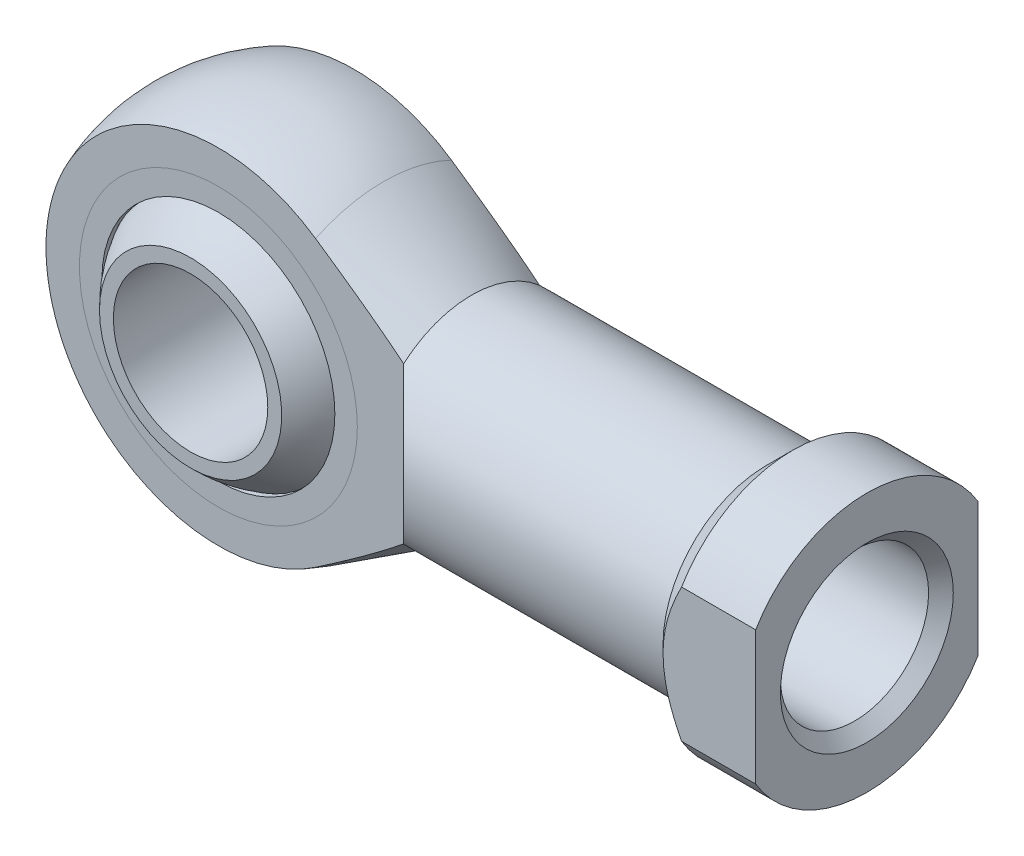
ISO-10303-21;
HEADER;
FILE_DESCRIPTION(('STEP AP214'),'2;1');
FILE_NAME('part.step','',(''),(''),'','','');
FILE_SCHEMA(('AUTOMOTIVE_DESIGN { 1 0 10303 214 1 1 1 1 }'));
ENDSEC;
DATA;
#1=APPLICATION_CONTEXT('core data for automotive mechanical design processes');
#2=APPLICATION_PROTOCOL_DEFINITION('international standard','automotive_design',2000,#1);
#3=PRODUCT_CONTEXT('',#1,'mechanical');
#4=PRODUCT('Part','Part','',(#3));
#5=PRODUCT_RELATED_PRODUCT_CATEGORY('part','',(#4));
#6=PRODUCT_DEFINITION_FORMATION('','',#4);
#7=PRODUCT_DEFINITION_CONTEXT('part definition',#1,'design');
#8=PRODUCT_DEFINITION('design','',#6,#7);
#9=PRODUCT_DEFINITION_SHAPE('','',#8);
#10=(LENGTH_UNIT() NAMED_UNIT(*) SI_UNIT(.MILLI.,.METRE.));
#11=(NAMED_UNIT(*) PLANE_ANGLE_UNIT() SI_UNIT($,.RADIAN.));
#12=(NAMED_UNIT(*) SI_UNIT($,.STERADIAN.) SOLID_ANGLE_UNIT());
#13=UNCERTAINTY_MEASURE_WITH_UNIT(LENGTH_MEASURE(1.E-05),#10,'distance_accuracy_value','');
#14=(GEOMETRIC_REPRESENTATION_CONTEXT(3) GLOBAL_UNCERTAINTY_ASSIGNED_CONTEXT((#13)) GLOBAL_UNIT_ASSIGNED_CONTEXT((#10,
#11,#12)) REPRESENTATION_CONTEXT('',''));
#15=CARTESIAN_POINT('',(0.,0.,0.));
#16=DIRECTION('',(0.,0.,1.));
#17=DIRECTION('',(1.,0.,0.));
#18=AXIS2_PLACEMENT_3D('',#15,#16,#17);
#19=CARTESIAN_POINT('',(0.,0.,0.));
#20=DIRECTION('',(0.,1.,0.));
#21=DIRECTION('',(1.,0.,0.));
#22=AXIS2_PLACEMENT_3D('',#19,#20,#21);
#23=SPHERICAL_SURFACE('',#22,21.4);
#24=CARTESIAN_POINT('',(0.,0.,0.));
#25=DIRECTION('',(0.,0.,-1.));
#26=DIRECTION('',(-1.,0.,0.));
#27=AXIS2_PLACEMENT_3D('',#24,#25,#26);
#28=SPHERICAL_SURFACE('',#27,21.4);
#29=CARTESIAN_POINT('',(0.,0.,15.5));
#30=DIRECTION('',(0.,0.,-1.));
#31=DIRECTION('',(-1.,0.,0.));
#32=AXIS2_PLACEMENT_3D('',#29,#30,#31);
#33=CIRCLE('',#32,14.7549991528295);
#34=CARTESIAN_POINT('',(-14.7549991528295,0.,15.5));
#35=VERTEX_POINT('',#34);
#36=EDGE_CURVE('P0_E26',#35,#35,#33,.F.);
#37=ORIENTED_EDGE('',*,*,#36,.F.);
#38=EDGE_LOOP('',(#37));
#39=FACE_BOUND('',#38,.T.);
#40=CARTESIAN_POINT('',(0.,0.,-15.5));
#41=DIRECTION('',(0.,0.,1.));
#42=DIRECTION('',(1.,0.,0.));
#43=AXIS2_PLACEMENT_3D('',#40,#41,#42);
#44=CIRCLE('',#43,14.7549991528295);
#45=CARTESIAN_POINT('',(14.7549991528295,0.,-15.5));
#46=VERTEX_POINT('',#45);
#47=EDGE_CURVE('P0_E10',#46,#46,#44,.F.);
#48=ORIENTED_EDGE('',*,*,#47,.F.);
#49=EDGE_LOOP('',(#48));
#50=FACE_BOUND('',#49,.T.);
#51=ADVANCED_FACE('P0_F14',(#39,#50),#28,.T.);
#52=CARTESIAN_POINT('',(0.,0.,-21.4));
#53=DIRECTION('',(0.,0.,1.));
#54=DIRECTION('',(1.,0.,0.));
#55=AXIS2_PLACEMENT_3D('',#52,#53,#54);
#56=CYLINDRICAL_SURFACE('',#55,12.5);
#57=CARTESIAN_POINT('',(0.,0.,15.5));
#58=DIRECTION('',(0.,0.,-1.));
#59=DIRECTION('',(-1.,0.,0.));
#60=AXIS2_PLACEMENT_3D('',#57,#58,#59);
#61=CIRCLE('',#60,12.5);
#62=CARTESIAN_POINT('',(-12.5,0.,15.5));
#63=VERTEX_POINT('',#62);
#64=EDGE_CURVE('P0_E17',#63,#63,#61,.F.);
#65=ORIENTED_EDGE('',*,*,#64,.T.);
#66=EDGE_LOOP('',(#65));
#67=FACE_BOUND('',#66,.T.);
#68=CARTESIAN_POINT('',(0.,0.,-15.5));
#69=DIRECTION('',(0.,0.,1.));
#70=DIRECTION('',(1.,0.,0.));
#71=AXIS2_PLACEMENT_3D('',#68,#69,#70);
#72=CIRCLE('',#71,12.5);
#73=CARTESIAN_POINT('',(12.5,0.,-15.5));
#74=VERTEX_POINT('',#73);
#75=EDGE_CURVE('P0_E21',#74,#74,#72,.F.);
#76=ORIENTED_EDGE('',*,*,#75,.T.);
#77=EDGE_LOOP('',(#76));
#78=FACE_BOUND('',#77,.T.);
#79=ADVANCED_FACE('P0_F34',(#67,#78),#56,.F.);
#80=CARTESIAN_POINT('',(-21.4,-21.4,-15.5));
#81=DIRECTION('',(0.,0.,1.));
#82=DIRECTION('',(1.,0.,0.));
#83=AXIS2_PLACEMENT_3D('',#80,#81,#82);
#84=PLANE('',#83);
#85=ORIENTED_EDGE('',*,*,#47,.T.);
#86=EDGE_LOOP('',(#85));
#87=FACE_BOUND('',#86,.T.);
#88=ORIENTED_EDGE('',*,*,#75,.F.);
#89=EDGE_LOOP('',(#88));
#90=FACE_BOUND('',#89,.T.);
#91=ADVANCED_FACE('P0_F39',(#87,#90),#84,.F.);
#92=CARTESIAN_POINT('',(-21.4,-21.4,15.5));
#93=DIRECTION('',(0.,0.,-1.));
#94=DIRECTION('',(-1.,0.,0.));
#95=AXIS2_PLACEMENT_3D('',#92,#93,#94);
#96=PLANE('',#95);
#97=ORIENTED_EDGE('',*,*,#36,.T.);
#98=EDGE_LOOP('',(#97));
#99=FACE_BOUND('',#98,.T.);
#100=ORIENTED_EDGE('',*,*,#64,.F.);
#101=EDGE_LOOP('',(#100));
#102=FACE_BOUND('',#101,.T.);
#103=ADVANCED_FACE('P0_F37',(#99,#102),#96,.F.);
#104=CLOSED_SHELL('',(#51,#79,#91,#103));
#105=MANIFOLD_SOLID_BREP('P0_B1',#104);
#106=CARTESIAN_POINT('',(0.,0.,11.));
#107=DIRECTION('',(0.,0.,1.));
#108=DIRECTION('',(1.,0.,0.));
#109=AXIS2_PLACEMENT_3D('',#106,#107,#108);
#110=PLANE('',#109);
#111=CARTESIAN_POINT('',(0.,0.,11.));
#112=DIRECTION('',(0.,0.,1.));
#113=DIRECTION('',(1.,0.,0.));
#114=AXIS2_PLACEMENT_3D('',#111,#112,#113);
#115=CIRCLE('',#114,22.5);
#116=CARTESIAN_POINT('',(22.5,0.,11.));
#117=VERTEX_POINT('',#116);
#118=EDGE_CURVE('P1_E10',#117,#117,#115,.T.);
#119=ORIENTED_EDGE('',*,*,#118,.T.);
#120=EDGE_LOOP('',(#119));
#121=FACE_BOUND('',#120,.T.);
#122=CARTESIAN_POINT('',(0.,0.,11.));
#123=DIRECTION('',(0.,0.,1.));
#124=DIRECTION('',(1.,0.,0.));
#125=AXIS2_PLACEMENT_3D('',#122,#123,#124);
#126=CIRCLE('',#125,18.865);
#127=CARTESIAN_POINT('',(18.865,0.,11.));
#128=VERTEX_POINT('',#127);
#129=EDGE_CURVE('P1_E25',#128,#128,#126,.T.);
#130=ORIENTED_EDGE('',*,*,#129,.F.);
#131=EDGE_LOOP('',(#130));
#132=FACE_BOUND('',#131,.T.);
#133=ADVANCED_FACE('P1_F14',(#121,#132),#110,.T.);
#134=CARTESIAN_POINT('',(0.,0.,10.1));
#135=DIRECTION('',(0.,0.,1.));
#136=DIRECTION('',(1.,0.,0.));
#137=AXIS2_PLACEMENT_3D('',#134,#135,#136);
#138=PLANE('',#137);
#139=CARTESIAN_POINT('',(0.,0.,10.1));
#140=DIRECTION('',(0.,0.,1.));
#141=DIRECTION('',(1.,0.,0.));
#142=AXIS2_PLACEMENT_3D('',#139,#140,#141);
#143=CIRCLE('',#142,22.5);
#144=CARTESIAN_POINT('',(22.5,0.,10.1));
#145=VERTEX_POINT('',#144);
#146=EDGE_CURVE('P1_E18',#145,#145,#143,.T.);
#147=ORIENTED_EDGE('',*,*,#146,.F.);
#148=EDGE_LOOP('',(#147));
#149=FACE_BOUND('',#148,.T.);
#150=CARTESIAN_POINT('',(0.,0.,10.1));
#151=DIRECTION('',(0.,0.,1.));
#152=DIRECTION('',(1.,0.,0.));
#153=AXIS2_PLACEMENT_3D('',#150,#151,#152);
#154=CIRCLE('',#153,18.865);
#155=CARTESIAN_POINT('',(18.865,0.,10.1));
#156=VERTEX_POINT('',#155);
#157=EDGE_CURVE('P1_E27',#156,#156,#154,.T.);
#158=ORIENTED_EDGE('',*,*,#157,.T.);
#159=EDGE_LOOP('',(#158));
#160=FACE_BOUND('',#159,.T.);
#161=ADVANCED_FACE('P1_F37',(#149,#160),#138,.F.);
#162=CARTESIAN_POINT('',(0.,0.,11.));
#163=DIRECTION('',(0.,0.,-1.));
#164=DIRECTION('',(-1.,0.,0.));
#165=AXIS2_PLACEMENT_3D('',#162,#163,#164);
#166=CYLINDRICAL_SURFACE('',#165,22.5);
#167=ORIENTED_EDGE('',*,*,#118,.F.);
#168=EDGE_LOOP('',(#167));
#169=FACE_BOUND('',#168,.T.);
#170=ORIENTED_EDGE('',*,*,#146,.T.);
#171=EDGE_LOOP('',(#170));
#172=FACE_BOUND('',#171,.T.);
#173=ADVANCED_FACE('P1_F16',(#169,#172),#166,.T.);
#174=CARTESIAN_POINT('',(0.,0.,11.));
#175=DIRECTION('',(0.,0.,-1.));
#176=DIRECTION('',(-1.,0.,0.));
#177=AXIS2_PLACEMENT_3D('',#174,#175,#176);
#178=CYLINDRICAL_SURFACE('',#177,18.865);
#179=ORIENTED_EDGE('',*,*,#129,.T.);
#180=EDGE_LOOP('',(#179));
#181=FACE_BOUND('',#180,.T.);
#182=ORIENTED_EDGE('',*,*,#157,.F.);
#183=EDGE_LOOP('',(#182));
#184=FACE_BOUND('',#183,.T.);
#185=ADVANCED_FACE('P1_F33',(#181,#184),#178,.F.);
#186=CLOSED_SHELL('',(#133,#161,#173,#185));
#187=MANIFOLD_SOLID_BREP('P1_B1',#186);
#188=CARTESIAN_POINT('',(0.,0.,-10.1));
#189=DIRECTION('',(0.,0.,1.));
#190=DIRECTION('',(1.,0.,0.));
#191=AXIS2_PLACEMENT_3D('',#188,#189,#190);
#192=PLANE('',#191);
#193=CARTESIAN_POINT('',(0.,0.,-10.1));
#194=DIRECTION('',(0.,0.,1.));
#195=DIRECTION('',(1.,0.,0.));
#196=AXIS2_PLACEMENT_3D('',#193,#194,#195);
#197=CIRCLE('',#196,22.5);
#198=CARTESIAN_POINT('',(22.5,0.,-10.1));
#199=VERTEX_POINT('',#198);
#200=EDGE_CURVE('P2_E10',#199,#199,#197,.T.);
#201=ORIENTED_EDGE('',*,*,#200,.T.);
#202=EDGE_LOOP('',(#201));
#203=FACE_BOUND('',#202,.T.);
#204=CARTESIAN_POINT('',(0.,0.,-10.1));
#205=DIRECTION('',(0.,0.,1.));
#206=DIRECTION('',(1.,0.,0.));
#207=AXIS2_PLACEMENT_3D('',#204,#205,#206);
#208=CIRCLE('',#207,18.865);
#209=CARTESIAN_POINT('',(18.865,0.,-10.1));
#210=VERTEX_POINT('',#209);
#211=EDGE_CURVE('P2_E25',#210,#210,#208,.T.);
#212=ORIENTED_EDGE('',*,*,#211,.F.);
#213=EDGE_LOOP('',(#212));
#214=FACE_BOUND('',#213,.T.);
#215=ADVANCED_FACE('P2_F14',(#203,#214),#192,.T.);
#216=CARTESIAN_POINT('',(0.,0.,-11.));
#217=DIRECTION('',(0.,0.,1.));
#218=DIRECTION('',(1.,0.,0.));
#219=AXIS2_PLACEMENT_3D('',#216,#217,#218);
#220=PLANE('',#219);
#221=CARTESIAN_POINT('',(0.,0.,-11.));
#222=DIRECTION('',(0.,0.,1.));
#223=DIRECTION('',(1.,0.,0.));
#224=AXIS2_PLACEMENT_3D('',#221,#222,#223);
#225=CIRCLE('',#224,22.5);
#226=CARTESIAN_POINT('',(22.5,0.,-11.));
#227=VERTEX_POINT('',#226);
#228=EDGE_CURVE('P2_E18',#227,#227,#225,.T.);
#229=ORIENTED_EDGE('',*,*,#228,.F.);
#230=EDGE_LOOP('',(#229));
#231=FACE_BOUND('',#230,.T.);
#232=CARTESIAN_POINT('',(0.,0.,-11.));
#233=DIRECTION('',(0.,0.,1.));
#234=DIRECTION('',(1.,0.,0.));
#235=AXIS2_PLACEMENT_3D('',#232,#233,#234);
#236=CIRCLE('',#235,18.865);
#237=CARTESIAN_POINT('',(18.865,0.,-11.));
#238=VERTEX_POINT('',#237);
#239=EDGE_CURVE('P2_E27',#238,#238,#236,.T.);
#240=ORIENTED_EDGE('',*,*,#239,.T.);
#241=EDGE_LOOP('',(#240));
#242=FACE_BOUND('',#241,.T.);
#243=ADVANCED_FACE('P2_F37',(#231,#242),#220,.F.);
#244=CARTESIAN_POINT('',(0.,0.,-10.1));
#245=DIRECTION('',(0.,0.,-1.));
#246=DIRECTION('',(-1.,0.,0.));
#247=AXIS2_PLACEMENT_3D('',#244,#245,#246);
#248=CYLINDRICAL_SURFACE('',#247,22.5);
#249=ORIENTED_EDGE('',*,*,#200,.F.);
#250=EDGE_LOOP('',(#249));
#251=FACE_BOUND('',#250,.T.);
#252=ORIENTED_EDGE('',*,*,#228,.T.);
#253=EDGE_LOOP('',(#252));
#254=FACE_BOUND('',#253,.T.);
#255=ADVANCED_FACE('P2_F16',(#251,#254),#248,.T.);
#256=CARTESIAN_POINT('',(0.,0.,-10.1));
#257=DIRECTION('',(0.,0.,-1.));
#258=DIRECTION('',(-1.,0.,0.));
#259=AXIS2_PLACEMENT_3D('',#256,#257,#258);
#260=CYLINDRICAL_SURFACE('',#259,18.865);
#261=ORIENTED_EDGE('',*,*,#211,.T.);
#262=EDGE_LOOP('',(#261));
#263=FACE_BOUND('',#262,.T.);
#264=ORIENTED_EDGE('',*,*,#239,.F.);
#265=EDGE_LOOP('',(#264));
#266=FACE_BOUND('',#265,.T.);
#267=ADVANCED_FACE('P2_F33',(#263,#266),#260,.F.);
#268=CLOSED_SHELL('',(#215,#243,#255,#267));
#269=MANIFOLD_SOLID_BREP('P2_B1',#268);
#270=CARTESIAN_POINT('',(0.,0.,0.));
#271=DIRECTION('',(0.,1.,0.));
#272=DIRECTION('',(1.,0.,0.));
#273=AXIS2_PLACEMENT_3D('',#270,#271,#272);
#274=SPHERICAL_SURFACE('',#273,21.4);
#275=CARTESIAN_POINT('',(0.,0.,0.));
#276=DIRECTION('',(0.,0.,1.));
#277=DIRECTION('',(1.,0.,0.));
#278=AXIS2_PLACEMENT_3D('',#275,#276,#277);
#279=SPHERICAL_SURFACE('',#278,21.4);
#280=CARTESIAN_POINT('',(0.,0.,10.1));
#281=DIRECTION('',(0.,0.,1.));
#282=DIRECTION('',(1.,0.,0.));
#283=AXIS2_PLACEMENT_3D('',#280,#281,#282);
#284=CIRCLE('',#283,18.8666372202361);
#285=CARTESIAN_POINT('',(18.8666372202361,0.,10.1));
#286=VERTEX_POINT('',#285);
#287=EDGE_CURVE('P3_E73',#286,#286,#284,.F.);
#288=ORIENTED_EDGE('',*,*,#287,.F.);
#289=EDGE_LOOP('',(#288));
#290=FACE_BOUND('',#289,.T.);
#291=CARTESIAN_POINT('',(0.,0.,-10.1));
#292=DIRECTION('',(0.,0.,-1.));
#293=DIRECTION('',(-1.,0.,0.));
#294=AXIS2_PLACEMENT_3D('',#291,#292,#293);
#295=CIRCLE('',#294,18.8666372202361);
#296=CARTESIAN_POINT('',(-18.8666372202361,0.,-10.1));
#297=VERTEX_POINT('',#296);
#298=EDGE_CURVE('P3_E20',#297,#297,#295,.F.);
#299=ORIENTED_EDGE('',*,*,#298,.F.);
#300=EDGE_LOOP('',(#299));
#301=FACE_BOUND('',#300,.T.);
#302=ADVANCED_FACE('P3_F16',(#290,#301),#279,.F.);
#303=CARTESIAN_POINT('',(-30.,-30.,-11.));
#304=DIRECTION('',(0.,0.,1.));
#305=DIRECTION('',(1.,0.,0.));
#306=AXIS2_PLACEMENT_3D('',#303,#304,#305);
#307=PLANE('',#306);
#308=CARTESIAN_POINT('',(0.,0.,-11.));
#309=DIRECTION('',(0.,0.,1.));
#310=DIRECTION('',(1.,0.,0.));
#311=AXIS2_PLACEMENT_3D('',#308,#309,#310);
#312=CIRCLE('',#311,27.9105714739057);
#313=CARTESIAN_POINT('',(15.740907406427,23.0482935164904,-11.));
#314=VERTEX_POINT('',#313);
#315=CARTESIAN_POINT('',(15.740907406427,-23.0482935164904,-11.));
#316=VERTEX_POINT('',#315);
#317=EDGE_CURVE('P3_E11',#314,#316,#312,.T.);
#318=ORIENTED_EDGE('',*,*,#317,.F.);
#319=CARTESIAN_POINT('',(-18.0945564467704,-45.0704270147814,-11.));
#320=CARTESIAN_POINT('',(-17.0568004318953,-44.4120174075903,-11.));
#321=CARTESIAN_POINT('',(-16.0194039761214,-43.753040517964,-11.));
#322=CARTESIAN_POINT('',(-13.9454507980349,-42.4337641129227,-11.));
#323=CARTESIAN_POINT('',(-12.9088940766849,-41.7734645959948,-11.));
#324=CARTESIAN_POINT('',(-10.8365143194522,-40.4512102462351,-11.));
#325=CARTESIAN_POINT('',(-9.80069149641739,-39.7892550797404,-11.));
#326=CARTESIAN_POINT('',(-7.73016416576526,-38.4635987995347,-11.));
#327=CARTESIAN_POINT('',(-6.69545965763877,-37.7998976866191,-11.));
#328=CARTESIAN_POINT('',(-4.62044809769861,-36.4660227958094,-11.));
#329=CARTESIAN_POINT('',(-3.5801497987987,-35.7958353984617,-11.));
#330=CARTESIAN_POINT('',(-1.50111563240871,-34.4530416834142,-11.));
#331=CARTESIAN_POINT('',(-0.462379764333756,-33.7804353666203,-11.));
#332=CARTESIAN_POINT('',(1.61301945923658,-32.4324901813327,-11.));
#333=CARTESIAN_POINT('',(2.64968319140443,-31.757151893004,-11.));
#334=CARTESIAN_POINT('',(4.72076116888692,-30.4030398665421,-11.));
#335=CARTESIAN_POINT('',(5.75517542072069,-29.7242661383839,-11.));
#336=CARTESIAN_POINT('',(7.8800204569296,-28.3238215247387,-11.));
#337=CARTESIAN_POINT('',(8.97029063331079,-27.6019067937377,-11.));
#338=CARTESIAN_POINT('',(11.1469904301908,-26.1522743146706,-11.));
#339=CARTESIAN_POINT('',(12.233420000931,-25.4245564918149,-11.));
#340=CARTESIAN_POINT('',(14.4020257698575,-23.9613019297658,-11.));
#341=CARTESIAN_POINT('',(15.4841987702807,-23.225760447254,-11.));
#342=CARTESIAN_POINT('',(17.6419891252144,-21.7451952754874,-11.));
#343=CARTESIAN_POINT('',(18.7176067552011,-21.0001719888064,-11.));
#344=CARTESIAN_POINT('',(20.3224225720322,-19.8744861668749,-11.));
#345=CARTESIAN_POINT('',(20.8549648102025,-19.4985904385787,-11.));
#346=CARTESIAN_POINT('',(21.9174243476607,-18.7431095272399,-11.));
#347=CARTESIAN_POINT('',(22.4473416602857,-18.363524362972,-11.));
#348=CARTESIAN_POINT('',(23.5041469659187,-17.5999459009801,-11.));
#349=CARTESIAN_POINT('',(24.0310343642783,-17.2159517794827,-11.));
#350=CARTESIAN_POINT('',(25.0810156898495,-16.4428134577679,-11.));
#351=CARTESIAN_POINT('',(25.6041096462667,-16.0536692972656,-11.));
#352=CARTESIAN_POINT('',(26.6450647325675,-15.2696298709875,-11.));
#353=CARTESIAN_POINT('',(27.1629310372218,-14.874741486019,-11.));
#354=CARTESIAN_POINT('',(28.1928866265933,-14.0774450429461,-11.));
#355=CARTESIAN_POINT('',(28.7049757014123,-13.6750367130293,-11.));
#356=CARTESIAN_POINT('',(29.7215861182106,-12.8611074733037,-11.));
#357=CARTESIAN_POINT('',(30.2261099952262,-12.4495897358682,-11.));
#358=CARTESIAN_POINT('',(31.2254979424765,-11.6150137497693,-11.));
#359=CARTESIAN_POINT('',(31.720362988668,-11.1919566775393,-11.));
#360=CARTESIAN_POINT('',(32.3807622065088,-10.6098833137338,-11.));
#361=CARTESIAN_POINT('',(32.5520005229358,-10.4573267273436,-11.));
#362=CARTESIAN_POINT('',(32.892667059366,-10.1501878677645,-11.));
#363=CARTESIAN_POINT('',(33.0620951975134,-9.99560550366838,-11.));
#364=CARTESIAN_POINT('',(33.3989329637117,-9.68420915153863,-11.));
#365=CARTESIAN_POINT('',(33.5663423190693,-9.52739486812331,-11.));
#366=CARTESIAN_POINT('',(33.8988453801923,-9.21133499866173,-11.));
#367=CARTESIAN_POINT('',(34.0639391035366,-9.05208943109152,-11.));
#368=CARTESIAN_POINT('',(34.5559252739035,-8.56972462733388,-11.));
#369=CARTESIAN_POINT('',(34.8788855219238,-8.24256248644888,-11.));
#370=CARTESIAN_POINT('',(35.5110116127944,-7.5751529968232,-11.));
#371=CARTESIAN_POINT('',(35.8201791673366,-7.23490728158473,-11.));
#372=CARTESIAN_POINT('',(36.3694514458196,-6.59690169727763,-11.));
#373=CARTESIAN_POINT('',(36.6124245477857,-6.30162427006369,-11.));
#374=CARTESIAN_POINT('',(37.0815829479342,-5.69773242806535,-11.));
#375=CARTESIAN_POINT('',(37.3077626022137,-5.38911358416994,-11.));
#376=CARTESIAN_POINT('',(37.7368800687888,-4.75754699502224,-11.));
#377=CARTESIAN_POINT('',(37.939896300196,-4.43465306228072,-11.));
#378=CARTESIAN_POINT('',(38.3157365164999,-3.77177816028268,-11.));
#379=CARTESIAN_POINT('',(38.4885918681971,-3.43181542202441,-11.));
#380=CARTESIAN_POINT('',(38.7283814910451,-2.88415659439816,-11.));
#381=CARTESIAN_POINT('',(38.8089129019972,-2.68239986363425,-11.));
#382=CARTESIAN_POINT('',(38.954707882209,-2.27347666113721,-11.));
#383=CARTESIAN_POINT('',(39.0199781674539,-2.06631261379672,-11.));
#384=CARTESIAN_POINT('',(39.1329817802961,-1.64784519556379,-11.));
#385=CARTESIAN_POINT('',(39.1807638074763,-1.43655507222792,-11.));
#386=CARTESIAN_POINT('',(39.2571495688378,-1.01061091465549,-11.));
#387=CARTESIAN_POINT('',(39.2857669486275,-0.795959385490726,-11.));
#388=CARTESIAN_POINT('',(39.3124485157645,-0.483988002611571,-11.));
#389=CARTESIAN_POINT('',(39.3186581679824,-0.387313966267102,-11.));
#390=CARTESIAN_POINT('',(39.3269502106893,-0.193765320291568,-11.));
#391=CARTESIAN_POINT('',(39.3290315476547,-0.0968906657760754,-11.));
#392=CARTESIAN_POINT('',(39.3290209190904,0.225395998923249,-11.));
#393=CARTESIAN_POINT('',(39.3177327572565,0.450878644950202,-11.));
#394=CARTESIAN_POINT('',(39.273122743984,0.899746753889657,-11.));
#395=CARTESIAN_POINT('',(39.2397844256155,1.12313052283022,-11.));
#396=CARTESIAN_POINT('',(39.1525359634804,1.56638676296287,-11.));
#397=CARTESIAN_POINT('',(39.09857479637,1.78624910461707,-11.));
#398=CARTESIAN_POINT('',(38.9723216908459,2.22056408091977,-11.));
#399=CARTESIAN_POINT('',(38.9000300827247,2.43501681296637,-11.));
#400=CARTESIAN_POINT('',(38.7037249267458,2.95228293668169,-11.));
#401=CARTESIAN_POINT('',(38.5710292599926,3.25179952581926,-11.));
#402=CARTESIAN_POINT('',(38.2794496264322,3.83777904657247,-11.));
#403=CARTESIAN_POINT('',(38.1205477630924,4.12423288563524,-11.));
#404=CARTESIAN_POINT('',(37.781838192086,4.68585474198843,-11.));
#405=CARTESIAN_POINT('',(37.6019548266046,4.96097675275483,-11.));
#406=CARTESIAN_POINT('',(37.3202968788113,5.36522929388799,-11.));
#407=CARTESIAN_POINT('',(37.2244509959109,5.49855951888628,-11.));
#408=CARTESIAN_POINT('',(37.0292405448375,5.76262180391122,-11.));
#409=CARTESIAN_POINT('',(36.9298759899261,5.89335387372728,-11.));
#410=CARTESIAN_POINT('',(36.6550619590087,6.24605126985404,-11.));
#411=CARTESIAN_POINT('',(36.4765498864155,6.46563201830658,-11.));
#412=CARTESIAN_POINT('',(36.111970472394,6.8984520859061,-11.));
#413=CARTESIAN_POINT('',(35.9259019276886,7.11169038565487,-11.));
#414=CARTESIAN_POINT('',(35.547433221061,7.53267300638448,-11.));
#415=CARTESIAN_POINT('',(35.3550295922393,7.74041420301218,-11.));
#416=CARTESIAN_POINT('',(34.9650061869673,8.15095029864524,-11.));
#417=CARTESIAN_POINT('',(34.7673860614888,8.35374486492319,-11.));
#418=CARTESIAN_POINT('',(34.1670377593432,8.95653631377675,-11.));
#419=CARTESIAN_POINT('',(33.7577111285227,9.34996637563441,-11.));
#420=CARTESIAN_POINT('',(32.9264776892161,10.1229357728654,-11.));
#421=CARTESIAN_POINT('',(32.5045745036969,10.502479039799,-11.));
#422=CARTESIAN_POINT('',(31.6468714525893,11.2543561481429,-11.));
#423=CARTESIAN_POINT('',(31.210974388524,11.6265787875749,-11.));
#424=CARTESIAN_POINT('',(30.3316101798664,12.3619949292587,-11.));
#425=CARTESIAN_POINT('',(29.8881425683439,12.7251878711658,-11.));
#426=CARTESIAN_POINT('',(28.9959539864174,13.4435954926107,-11.));
#427=CARTESIAN_POINT('',(28.5472423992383,13.7988218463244,-11.));
#428=CARTESIAN_POINT('',(27.8705987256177,14.3270515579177,-11.));
#429=CARTESIAN_POINT('',(27.644457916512,14.5023574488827,-11.));
#430=CARTESIAN_POINT('',(27.1910925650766,14.851562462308,-11.));
#431=CARTESIAN_POINT('',(26.9638680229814,15.0254615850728,-11.));
#432=CARTESIAN_POINT('',(26.2719737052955,15.5518888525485,-11.));
#433=CARTESIAN_POINT('',(25.8057593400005,15.9023880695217,-11.));
#434=CARTESIAN_POINT('',(24.8699713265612,16.5988772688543,-11.));
#435=CARTESIAN_POINT('',(24.4003976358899,16.9448671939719,-11.));
#436=CARTESIAN_POINT('',(23.4584197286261,17.6330136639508,-11.));
#437=CARTESIAN_POINT('',(22.9860153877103,17.9751700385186,-11.));
#438=CARTESIAN_POINT('',(22.0388240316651,18.6561705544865,-11.));
#439=CARTESIAN_POINT('',(21.5640370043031,18.9950146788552,-11.));
#440=CARTESIAN_POINT('',(20.1364750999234,20.0073769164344,-11.));
#441=CARTESIAN_POINT('',(19.1806596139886,20.676608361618,-11.));
#442=CARTESIAN_POINT('',(17.2629749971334,22.006339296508,-11.));
#443=CARTESIAN_POINT('',(16.3011058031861,22.6668386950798,-11.));
#444=CARTESIAN_POINT('',(14.371358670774,23.9818892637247,-11.));
#445=CARTESIAN_POINT('',(13.403474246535,24.6364309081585,-11.));
#446=CARTESIAN_POINT('',(11.4640109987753,25.9400227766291,-11.));
#447=CARTESIAN_POINT('',(10.4924321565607,26.5890729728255,-11.));
#448=CARTESIAN_POINT('',(8.5464194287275,27.8826398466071,-11.));
#449=CARTESIAN_POINT('',(7.5719858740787,28.5271570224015,-11.));
#450=CARTESIAN_POINT('',(5.62069670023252,29.8125142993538,-11.));
#451=CARTESIAN_POINT('',(4.64384107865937,30.4533543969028,-11.));
#452=CARTESIAN_POINT('',(1.86011033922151,32.2733477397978,-11.));
#453=CARTESIAN_POINT('',(0.0508335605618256,33.4488273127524,-11.));
#454=CARTESIAN_POINT('',(-3.57269471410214,35.7922168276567,-11.));
#455=CARTESIAN_POINT('',(-5.38694637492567,36.9601265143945,-11.));
#456=CARTESIAN_POINT('',(-9.01519510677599,39.2876381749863,-11.));
#457=CARTESIAN_POINT('',(-10.8291841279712,40.4472527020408,-11.));
#458=CARTESIAN_POINT('',(-13.5522620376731,42.1833047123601,-11.));
#459=CARTESIAN_POINT('',(-14.4602851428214,42.7614152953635,-11.));
#460=CARTESIAN_POINT('',(-16.2769647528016,43.9166393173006,-11.));
#461=CARTESIAN_POINT('',(-17.185621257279,44.4937527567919,-11.));
#462=CARTESIAN_POINT('',(-18.0945564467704,45.0704270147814,-11.));
#463=B_SPLINE_CURVE_WITH_KNOTS('',3,(#319,#320,#321,#322,#323,#324,#325,#326,#327,#328,#329,
#330,#331,#332,#333,#334,#335,#336,#337,#338,#339,#340,#341,#342,#343,#344,#345,#346,#347,#348,
#349,#350,#351,#352,#353,#354,#355,#356,#357,#358,#359,#360,#361,#362,#363,#364,#365,#366,#367,
#368,#369,#370,#371,#372,#373,#374,#375,#376,#377,#378,#379,#380,#381,#382,#383,#384,#385,#386,
#387,#388,#389,#390,#391,#392,#393,#394,#395,#396,#397,#398,#399,#400,#401,#402,#403,#404,#405,
#406,#407,#408,#409,#410,#411,#412,#413,#414,#415,#416,#417,#418,#419,#420,#421,#422,#423,#424,
#425,#426,#427,#428,#429,#430,#431,#432,#433,#434,#435,#436,#437,#438,#439,#440,#441,#442,#443,
#444,#445,#446,#447,#448,#449,#450,#451,#452,#453,#454,#455,#456,#457,#458,#459,#460,#461,#462),
.UNSPECIFIED.,.F.,.F.,(4,2,2,2,2,2,2,2,2,2,2,2,2,2,2,2,2,2,2,2,2,2,2,2,2,2,2,2,2,2,2,2,2,2,2,2,
2,2,2,2,2,2,2,2,2,2,2,2,2,2,2,2,2,2,2,2,2,2,2,2,2,2,2,2,2,2,2,2,2,2,2,4),(0.,3.68699996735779,
7.37400415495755,11.061823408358,14.7496409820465,18.4620962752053,22.1745501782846,
25.886253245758,29.5979455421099,33.5207680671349,37.4436412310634,41.3690462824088,
45.2942852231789,47.2498008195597,49.2053064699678,51.1611836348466,53.1170457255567,
55.0707316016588,57.0244882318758,58.9775748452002,60.9304630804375,61.6184655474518,
62.3064989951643,62.9946243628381,63.6827445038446,65.0615791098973,66.4402421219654,
67.5869644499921,68.734070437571,69.8771698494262,71.0190732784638,71.6702800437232,
72.3211996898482,72.9702926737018,73.6189229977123,73.9094675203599,74.2000861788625,
74.8761500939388,75.5527194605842,76.2309736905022,76.9092156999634,77.89026684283,
78.8719907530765,79.8573710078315,80.3499425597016,80.8425122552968,81.6912540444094,
82.5401315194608,83.3894815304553,84.2388885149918,85.9416570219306,87.6439396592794,
89.3633775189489,91.0829218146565,92.7997554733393,93.6581487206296,94.516541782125,
96.2663198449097,98.0161200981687,99.7659977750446,101.515884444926,105.016252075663,
108.516656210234,112.021917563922,115.52719667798,119.032084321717,122.536975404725,
129.009743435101,135.482728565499,141.941617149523,145.170929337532,148.400239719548),.UNSPECIFIED.);
#464=CARTESIAN_POINT('',(30.,12.6318050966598,-11.));
#465=VERTEX_POINT('',#464);
#466=EDGE_CURVE('P3_E102',#465,#314,#463,.T.);
#467=ORIENTED_EDGE('',*,*,#466,.F.);
#468=DIRECTION('',(0.,1.,0.));
#469=VECTOR('',#468,1.);
#470=CARTESIAN_POINT('',(30.,-30.,-11.));
#471=LINE('',#470,#469);
#472=CARTESIAN_POINT('',(30.,-12.6318050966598,-11.));
#473=VERTEX_POINT('',#472);
#474=EDGE_CURVE('P3_E64',#473,#465,#471,.T.);
#475=ORIENTED_EDGE('',*,*,#474,.F.);
#476=EDGE_CURVE('P3_E33',#316,#473,#463,.T.);
#477=ORIENTED_EDGE('',*,*,#476,.F.);
#478=EDGE_LOOP('',(#318,#467,#475,#477));
#479=FACE_BOUND('',#478,.T.);
#480=CARTESIAN_POINT('',(0.,0.,-11.));
#481=DIRECTION('',(0.,0.,1.));
#482=DIRECTION('',(1.,0.,0.));
#483=AXIS2_PLACEMENT_3D('',#480,#481,#482);
#484=CIRCLE('',#483,22.5);
#485=CARTESIAN_POINT('',(22.5,0.,-11.));
#486=VERTEX_POINT('',#485);
#487=EDGE_CURVE('P3_E95',#486,#486,#484,.T.);
#488=ORIENTED_EDGE('',*,*,#487,.T.);
#489=EDGE_LOOP('',(#488));
#490=FACE_BOUND('',#489,.T.);
#491=ADVANCED_FACE('P3_F115',(#479,#490),#307,.F.);
#492=CARTESIAN_POINT('',(30.,0.,0.));
#493=DIRECTION('',(-1.,0.,0.));
#494=DIRECTION('',(0.,0.,1.));
#495=AXIS2_PLACEMENT_3D('',#492,#493,#494);
#496=CONICAL_SURFACE('',#495,16.75,0.55235904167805);
#497=CARTESIAN_POINT('',(15.740907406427,0.,0.));
#498=DIRECTION('',(-1.,0.,0.));
#499=DIRECTION('',(0.,0.,1.));
#500=AXIS2_PLACEMENT_3D('',#497,#498,#499);
#501=CIRCLE('',#500,25.5386733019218);
#502=CARTESIAN_POINT('',(15.740907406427,-23.0482935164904,11.));
#503=VERTEX_POINT('',#502);
#504=EDGE_CURVE('P3_E79',#316,#503,#501,.T.);
#505=ORIENTED_EDGE('',*,*,#504,.F.);
#506=ORIENTED_EDGE('',*,*,#476,.T.);
#507=CARTESIAN_POINT('',(30.,0.,0.));
#508=DIRECTION('',(-1.,0.,0.));
#509=DIRECTION('',(0.,0.,1.));
#510=AXIS2_PLACEMENT_3D('',#507,#508,#509);
#511=CIRCLE('',#510,16.75);
#512=CARTESIAN_POINT('',(30.,-12.6318050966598,11.));
#513=VERTEX_POINT('',#512);
#514=EDGE_CURVE('P3_E70',#473,#513,#511,.T.);
#515=ORIENTED_EDGE('',*,*,#514,.T.);
#516=CARTESIAN_POINT('',(-18.0945564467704,45.0704270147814,11.));
#517=CARTESIAN_POINT('',(-17.0568004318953,44.4120174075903,11.));
#518=CARTESIAN_POINT('',(-16.0194039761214,43.753040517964,11.));
#519=CARTESIAN_POINT('',(-13.9454507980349,42.4337641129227,11.));
#520=CARTESIAN_POINT('',(-12.9088940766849,41.7734645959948,11.));
#521=CARTESIAN_POINT('',(-10.8365143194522,40.4512102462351,11.));
#522=CARTESIAN_POINT('',(-9.80069149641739,39.7892550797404,11.));
#523=CARTESIAN_POINT('',(-7.73016416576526,38.4635987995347,11.));
#524=CARTESIAN_POINT('',(-6.69545965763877,37.7998976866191,11.));
#525=CARTESIAN_POINT('',(-4.62044809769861,36.4660227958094,11.));
#526=CARTESIAN_POINT('',(-3.5801497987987,35.7958353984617,11.));
#527=CARTESIAN_POINT('',(-1.50111563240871,34.4530416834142,11.));
#528=CARTESIAN_POINT('',(-0.462379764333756,33.7804353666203,11.));
#529=CARTESIAN_POINT('',(1.61301945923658,32.4324901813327,11.));
#530=CARTESIAN_POINT('',(2.64968319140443,31.757151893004,11.));
#531=CARTESIAN_POINT('',(4.72076116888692,30.4030398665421,11.));
#532=CARTESIAN_POINT('',(5.75517542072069,29.7242661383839,11.));
#533=CARTESIAN_POINT('',(7.8800204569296,28.3238215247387,11.));
#534=CARTESIAN_POINT('',(8.97029063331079,27.6019067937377,11.));
#535=CARTESIAN_POINT('',(11.1469904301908,26.1522743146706,11.));
#536=CARTESIAN_POINT('',(12.233420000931,25.4245564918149,11.));
#537=CARTESIAN_POINT('',(14.4020257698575,23.9613019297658,11.));
#538=CARTESIAN_POINT('',(15.4841987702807,23.225760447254,11.));
#539=CARTESIAN_POINT('',(17.6419891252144,21.7451952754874,11.));
#540=CARTESIAN_POINT('',(18.7176067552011,21.0001719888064,11.));
#541=CARTESIAN_POINT('',(20.3224225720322,19.8744861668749,11.));
#542=CARTESIAN_POINT('',(20.8549648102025,19.4985904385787,11.));
#543=CARTESIAN_POINT('',(21.9174243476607,18.7431095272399,11.));
#544=CARTESIAN_POINT('',(22.4473416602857,18.363524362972,11.));
#545=CARTESIAN_POINT('',(23.5041469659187,17.5999459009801,11.));
#546=CARTESIAN_POINT('',(24.0310343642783,17.2159517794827,11.));
#547=CARTESIAN_POINT('',(25.0810156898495,16.4428134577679,11.));
#548=CARTESIAN_POINT('',(25.6041096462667,16.0536692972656,11.));
#549=CARTESIAN_POINT('',(26.6450647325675,15.2696298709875,11.));
#550=CARTESIAN_POINT('',(27.1629310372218,14.874741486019,11.));
#551=CARTESIAN_POINT('',(28.1928866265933,14.0774450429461,11.));
#552=CARTESIAN_POINT('',(28.7049757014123,13.6750367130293,11.));
#553=CARTESIAN_POINT('',(29.7215861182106,12.8611074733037,11.));
#554=CARTESIAN_POINT('',(30.2261099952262,12.4495897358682,11.));
#555=CARTESIAN_POINT('',(31.2254979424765,11.6150137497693,11.));
#556=CARTESIAN_POINT('',(31.720362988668,11.1919566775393,11.));
#557=CARTESIAN_POINT('',(32.3807622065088,10.6098833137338,11.));
#558=CARTESIAN_POINT('',(32.5520005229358,10.4573267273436,11.));
#559=CARTESIAN_POINT('',(32.892667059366,10.1501878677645,11.));
#560=CARTESIAN_POINT('',(33.0620951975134,9.99560550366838,11.));
#561=CARTESIAN_POINT('',(33.3989329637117,9.68420915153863,11.));
#562=CARTESIAN_POINT('',(33.5663423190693,9.52739486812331,11.));
#563=CARTESIAN_POINT('',(33.8988453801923,9.21133499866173,11.));
#564=CARTESIAN_POINT('',(34.0639391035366,9.05208943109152,11.));
#565=CARTESIAN_POINT('',(34.5559252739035,8.56972462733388,11.));
#566=CARTESIAN_POINT('',(34.8788855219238,8.24256248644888,11.));
#567=CARTESIAN_POINT('',(35.5110116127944,7.5751529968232,11.));
#568=CARTESIAN_POINT('',(35.8201791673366,7.23490728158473,11.));
#569=CARTESIAN_POINT('',(36.3694514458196,6.59690169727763,11.));
#570=CARTESIAN_POINT('',(36.6124245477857,6.30162427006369,11.));
#571=CARTESIAN_POINT('',(37.0815829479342,5.69773242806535,11.));
#572=CARTESIAN_POINT('',(37.3077626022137,5.38911358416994,11.));
#573=CARTESIAN_POINT('',(37.7368800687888,4.75754699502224,11.));
#574=CARTESIAN_POINT('',(37.939896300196,4.43465306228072,11.));
#575=CARTESIAN_POINT('',(38.3157365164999,3.77177816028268,11.));
#576=CARTESIAN_POINT('',(38.4885918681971,3.43181542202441,11.));
#577=CARTESIAN_POINT('',(38.7283814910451,2.88415659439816,11.));
#578=CARTESIAN_POINT('',(38.8089129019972,2.68239986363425,11.));
#579=CARTESIAN_POINT('',(38.954707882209,2.27347666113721,11.));
#580=CARTESIAN_POINT('',(39.0199781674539,2.06631261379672,11.));
#581=CARTESIAN_POINT('',(39.1329817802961,1.64784519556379,11.));
#582=CARTESIAN_POINT('',(39.1807638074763,1.43655507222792,11.));
#583=CARTESIAN_POINT('',(39.2571495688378,1.01061091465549,11.));
#584=CARTESIAN_POINT('',(39.2857669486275,0.795959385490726,11.));
#585=CARTESIAN_POINT('',(39.3124485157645,0.483988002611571,11.));
#586=CARTESIAN_POINT('',(39.3186581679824,0.387313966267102,11.));
#587=CARTESIAN_POINT('',(39.3269502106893,0.193765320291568,11.));
#588=CARTESIAN_POINT('',(39.3290315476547,0.0968906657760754,11.));
#589=CARTESIAN_POINT('',(39.3290209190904,-0.225395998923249,11.));
#590=CARTESIAN_POINT('',(39.3177327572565,-0.450878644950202,11.));
#591=CARTESIAN_POINT('',(39.273122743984,-0.899746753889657,11.));
#592=CARTESIAN_POINT('',(39.2397844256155,-1.12313052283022,11.));
#593=CARTESIAN_POINT('',(39.1525359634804,-1.56638676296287,11.));
#594=CARTESIAN_POINT('',(39.09857479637,-1.78624910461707,11.));
#595=CARTESIAN_POINT('',(38.9723216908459,-2.22056408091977,11.));
#596=CARTESIAN_POINT('',(38.9000300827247,-2.43501681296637,11.));
#597=CARTESIAN_POINT('',(38.7037249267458,-2.95228293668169,11.));
#598=CARTESIAN_POINT('',(38.5710292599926,-3.25179952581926,11.));
#599=CARTESIAN_POINT('',(38.2794496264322,-3.83777904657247,11.));
#600=CARTESIAN_POINT('',(38.1205477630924,-4.12423288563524,11.));
#601=CARTESIAN_POINT('',(37.781838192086,-4.68585474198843,11.));
#602=CARTESIAN_POINT('',(37.6019548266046,-4.96097675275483,11.));
#603=CARTESIAN_POINT('',(37.3202968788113,-5.36522929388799,11.));
#604=CARTESIAN_POINT('',(37.2244509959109,-5.49855951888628,11.));
#605=CARTESIAN_POINT('',(37.0292405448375,-5.76262180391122,11.));
#606=CARTESIAN_POINT('',(36.9298759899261,-5.89335387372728,11.));
#607=CARTESIAN_POINT('',(36.6550619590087,-6.24605126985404,11.));
#608=CARTESIAN_POINT('',(36.4765498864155,-6.46563201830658,11.));
#609=CARTESIAN_POINT('',(36.111970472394,-6.8984520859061,11.));
#610=CARTESIAN_POINT('',(35.9259019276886,-7.11169038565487,11.));
#611=CARTESIAN_POINT('',(35.547433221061,-7.53267300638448,11.));
#612=CARTESIAN_POINT('',(35.3550295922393,-7.74041420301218,11.));
#613=CARTESIAN_POINT('',(34.9650061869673,-8.15095029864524,11.));
#614=CARTESIAN_POINT('',(34.7673860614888,-8.35374486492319,11.));
#615=CARTESIAN_POINT('',(34.1670377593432,-8.95653631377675,11.));
#616=CARTESIAN_POINT('',(33.7577111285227,-9.34996637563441,11.));
#617=CARTESIAN_POINT('',(32.9264776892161,-10.1229357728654,11.));
#618=CARTESIAN_POINT('',(32.5045745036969,-10.502479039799,11.));
#619=CARTESIAN_POINT('',(31.6468714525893,-11.2543561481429,11.));
#620=CARTESIAN_POINT('',(31.210974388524,-11.6265787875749,11.));
#621=CARTESIAN_POINT('',(30.3316101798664,-12.3619949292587,11.));
#622=CARTESIAN_POINT('',(29.8881425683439,-12.7251878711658,11.));
#623=CARTESIAN_POINT('',(28.9959539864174,-13.4435954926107,11.));
#624=CARTESIAN_POINT('',(28.5472423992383,-13.7988218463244,11.));
#625=CARTESIAN_POINT('',(27.8705987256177,-14.3270515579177,11.));
#626=CARTESIAN_POINT('',(27.644457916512,-14.5023574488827,11.));
#627=CARTESIAN_POINT('',(27.1910925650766,-14.851562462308,11.));
#628=CARTESIAN_POINT('',(26.9638680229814,-15.0254615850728,11.));
#629=CARTESIAN_POINT('',(26.2719737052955,-15.5518888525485,11.));
#630=CARTESIAN_POINT('',(25.8057593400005,-15.9023880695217,11.));
#631=CARTESIAN_POINT('',(24.8699713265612,-16.5988772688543,11.));
#632=CARTESIAN_POINT('',(24.4003976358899,-16.9448671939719,11.));
#633=CARTESIAN_POINT('',(23.4584197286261,-17.6330136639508,11.));
#634=CARTESIAN_POINT('',(22.9860153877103,-17.9751700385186,11.));
#635=CARTESIAN_POINT('',(22.0388240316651,-18.6561705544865,11.));
#636=CARTESIAN_POINT('',(21.5640370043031,-18.9950146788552,11.));
#637=CARTESIAN_POINT('',(20.1364750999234,-20.0073769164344,11.));
#638=CARTESIAN_POINT('',(19.1806596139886,-20.676608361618,11.));
#639=CARTESIAN_POINT('',(17.2629749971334,-22.006339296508,11.));
#640=CARTESIAN_POINT('',(16.3011058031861,-22.6668386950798,11.));
#641=CARTESIAN_POINT('',(14.371358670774,-23.9818892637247,11.));
#642=CARTESIAN_POINT('',(13.403474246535,-24.6364309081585,11.));
#643=CARTESIAN_POINT('',(11.4640109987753,-25.9400227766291,11.));
#644=CARTESIAN_POINT('',(10.4924321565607,-26.5890729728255,11.));
#645=CARTESIAN_POINT('',(8.5464194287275,-27.8826398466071,11.));
#646=CARTESIAN_POINT('',(7.5719858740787,-28.5271570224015,11.));
#647=CARTESIAN_POINT('',(5.62069670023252,-29.8125142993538,11.));
#648=CARTESIAN_POINT('',(4.64384107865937,-30.4533543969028,11.));
#649=CARTESIAN_POINT('',(1.86011033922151,-32.2733477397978,11.));
#650=CARTESIAN_POINT('',(0.0508335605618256,-33.4488273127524,11.));
#651=CARTESIAN_POINT('',(-3.57269471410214,-35.7922168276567,11.));
#652=CARTESIAN_POINT('',(-5.38694637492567,-36.9601265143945,11.));
#653=CARTESIAN_POINT('',(-9.01519510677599,-39.2876381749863,11.));
#654=CARTESIAN_POINT('',(-10.8291841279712,-40.4472527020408,11.));
#655=CARTESIAN_POINT('',(-13.5522620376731,-42.1833047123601,11.));
#656=CARTESIAN_POINT('',(-14.4602851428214,-42.7614152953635,11.));
#657=CARTESIAN_POINT('',(-16.2769647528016,-43.9166393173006,11.));
#658=CARTESIAN_POINT('',(-17.185621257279,-44.4937527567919,11.));
#659=CARTESIAN_POINT('',(-18.0945564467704,-45.0704270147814,11.));
#660=B_SPLINE_CURVE_WITH_KNOTS('',3,(#516,#517,#518,#519,#520,#521,#522,#523,#524,#525,#526,
#527,#528,#529,#530,#531,#532,#533,#534,#535,#536,#537,#538,#539,#540,#541,#542,#543,#544,#545,
#546,#547,#548,#549,#550,#551,#552,#553,#554,#555,#556,#557,#558,#559,#560,#561,#562,#563,#564,
#565,#566,#567,#568,#569,#570,#571,#572,#573,#574,#575,#576,#577,#578,#579,#580,#581,#582,#583,
#584,#585,#586,#587,#588,#589,#590,#591,#592,#593,#594,#595,#596,#597,#598,#599,#600,#601,#602,
#603,#604,#605,#606,#607,#608,#609,#610,#611,#612,#613,#614,#615,#616,#617,#618,#619,#620,#621,
#622,#623,#624,#625,#626,#627,#628,#629,#630,#631,#632,#633,#634,#635,#636,#637,#638,#639,#640,
#641,#642,#643,#644,#645,#646,#647,#648,#649,#650,#651,#652,#653,#654,#655,#656,#657,#658,#659),
.UNSPECIFIED.,.F.,.F.,(4,2,2,2,2,2,2,2,2,2,2,2,2,2,2,2,2,2,2,2,2,2,2,2,2,2,2,2,2,2,2,2,2,2,2,2,
2,2,2,2,2,2,2,2,2,2,2,2,2,2,2,2,2,2,2,2,2,2,2,2,2,2,2,2,2,2,2,2,2,2,2,4),(0.,3.68699996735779,
7.37400415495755,11.061823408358,14.7496409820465,18.4620962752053,22.1745501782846,
25.886253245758,29.5979455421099,33.5207680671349,37.4436412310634,41.3690462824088,
45.2942852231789,47.2498008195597,49.2053064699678,51.1611836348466,53.1170457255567,
55.0707316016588,57.0244882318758,58.9775748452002,60.9304630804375,61.6184655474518,
62.3064989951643,62.9946243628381,63.6827445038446,65.0615791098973,66.4402421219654,
67.5869644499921,68.734070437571,69.8771698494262,71.0190732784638,71.6702800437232,
72.3211996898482,72.9702926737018,73.6189229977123,73.9094675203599,74.2000861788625,
74.8761500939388,75.5527194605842,76.2309736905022,76.9092156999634,77.89026684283,
78.8719907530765,79.8573710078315,80.3499425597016,80.8425122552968,81.6912540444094,
82.5401315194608,83.3894815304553,84.2388885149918,85.9416570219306,87.6439396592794,
89.3633775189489,91.0829218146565,92.7997554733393,93.6581487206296,94.516541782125,
96.2663198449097,98.0161200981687,99.7659977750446,101.515884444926,105.016252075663,
108.516656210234,112.021917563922,115.52719667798,119.032084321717,122.536975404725,
129.009743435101,135.482728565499,141.941617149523,145.170929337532,148.400239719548),.UNSPECIFIED.);
#661=EDGE_CURVE('P3_E56',#513,#503,#660,.T.);
#662=ORIENTED_EDGE('',*,*,#661,.T.);
#663=EDGE_LOOP('',(#505,#506,#515,#662));
#664=FACE_BOUND('',#663,.T.);
#665=ADVANCED_FACE('P3_F75',(#664),#496,.T.);
#666=CARTESIAN_POINT('',(30.,0.,0.));
#667=DIRECTION('',(-1.,0.,0.));
#668=DIRECTION('',(0.,0.,1.));
#669=AXIS2_PLACEMENT_3D('',#666,#667,#668);
#670=PLANE('',#669);
#671=ORIENTED_EDGE('',*,*,#514,.F.);
#672=ORIENTED_EDGE('',*,*,#474,.T.);
#673=CARTESIAN_POINT('',(30.,12.6318050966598,11.));
#674=VERTEX_POINT('',#673);
#675=EDGE_CURVE('P3_E72',#674,#465,#511,.T.);
#676=ORIENTED_EDGE('',*,*,#675,.F.);
#677=DIRECTION('',(0.,1.,0.));
#678=VECTOR('',#677,1.);
#679=CARTESIAN_POINT('',(30.,-30.,11.));
#680=LINE('',#679,#678);
#681=EDGE_CURVE('P3_E59',#513,#674,#680,.T.);
#682=ORIENTED_EDGE('',*,*,#681,.F.);
#683=EDGE_LOOP('',(#671,#672,#676,#682));
#684=FACE_BOUND('',#683,.T.);
#685=ADVANCED_FACE('P3_F18',(#684),#670,.F.);
#686=ORIENTED_EDGE('',*,*,#675,.T.);
#687=ORIENTED_EDGE('',*,*,#466,.T.);
#688=CARTESIAN_POINT('',(15.740907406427,23.0482935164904,11.));
#689=VERTEX_POINT('',#688);
#690=EDGE_CURVE('P3_E76',#689,#314,#501,.T.);
#691=ORIENTED_EDGE('',*,*,#690,.F.);
#692=EDGE_CURVE('P3_E40',#689,#674,#660,.T.);
#693=ORIENTED_EDGE('',*,*,#692,.T.);
#694=EDGE_LOOP('',(#686,#687,#691,#693));
#695=FACE_BOUND('',#694,.T.);
#696=ADVANCED_FACE('P3_F107',(#695),#496,.T.);
#697=CARTESIAN_POINT('',(0.,0.,0.));
#698=DIRECTION('',(-1.,0.,0.));
#699=DIRECTION('',(0.,1.,0.));
#700=AXIS2_PLACEMENT_3D('',#697,#698,#699);
#701=SPHERICAL_SURFACE('',#700,30.);
#702=ORIENTED_EDGE('',*,*,#690,.T.);
#703=ORIENTED_EDGE('',*,*,#317,.T.);
#704=ORIENTED_EDGE('',*,*,#504,.T.);
#705=CARTESIAN_POINT('',(0.,0.,11.));
#706=DIRECTION('',(0.,0.,-1.));
#707=DIRECTION('',(-1.,0.,0.));
#708=AXIS2_PLACEMENT_3D('',#705,#706,#707);
#709=CIRCLE('',#708,27.9105714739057);
#710=EDGE_CURVE('P3_E25',#503,#689,#709,.T.);
#711=ORIENTED_EDGE('',*,*,#710,.T.);
#712=EDGE_LOOP('',(#702,#703,#704,#711));
#713=FACE_BOUND('',#712,.T.);
#714=ADVANCED_FACE('P3_F113',(#713),#701,.T.);
#715=CARTESIAN_POINT('',(-30.,-30.,11.));
#716=DIRECTION('',(0.,0.,-1.));
#717=DIRECTION('',(-1.,0.,0.));
#718=AXIS2_PLACEMENT_3D('',#715,#716,#717);
#719=PLANE('',#718);
#720=CARTESIAN_POINT('',(0.,0.,11.));
#721=DIRECTION('',(0.,0.,1.));
#722=DIRECTION('',(1.,0.,0.));
#723=AXIS2_PLACEMENT_3D('',#720,#721,#722);
#724=CIRCLE('',#723,22.5);
#725=CARTESIAN_POINT('',(22.5,0.,11.));
#726=VERTEX_POINT('',#725);
#727=EDGE_CURVE('P3_E88',#726,#726,#724,.T.);
#728=ORIENTED_EDGE('',*,*,#727,.F.);
#729=EDGE_LOOP('',(#728));
#730=FACE_BOUND('',#729,.T.);
#731=ORIENTED_EDGE('',*,*,#710,.F.);
#732=ORIENTED_EDGE('',*,*,#661,.F.);
#733=ORIENTED_EDGE('',*,*,#681,.T.);
#734=ORIENTED_EDGE('',*,*,#692,.F.);
#735=EDGE_LOOP('',(#731,#732,#733,#734));
#736=FACE_BOUND('',#735,.T.);
#737=ADVANCED_FACE('P3_F58',(#730,#736),#719,.F.);
#738=CARTESIAN_POINT('',(0.,0.,10.1));
#739=DIRECTION('',(0.,0.,1.));
#740=DIRECTION('',(1.,0.,0.));
#741=AXIS2_PLACEMENT_3D('',#738,#739,#740);
#742=PLANE('',#741);
#743=CARTESIAN_POINT('',(0.,0.,10.1));
#744=DIRECTION('',(0.,0.,1.));
#745=DIRECTION('',(1.,0.,0.));
#746=AXIS2_PLACEMENT_3D('',#743,#744,#745);
#747=CIRCLE('',#746,22.5);
#748=CARTESIAN_POINT('',(22.5,0.,10.1));
#749=VERTEX_POINT('',#748);
#750=EDGE_CURVE('P3_E84',#749,#749,#747,.T.);
#751=ORIENTED_EDGE('',*,*,#750,.T.);
#752=EDGE_LOOP('',(#751));
#753=FACE_BOUND('',#752,.T.);
#754=ORIENTED_EDGE('',*,*,#287,.T.);
#755=EDGE_LOOP('',(#754));
#756=FACE_BOUND('',#755,.T.);
#757=ADVANCED_FACE('P3_F112',(#753,#756),#742,.T.);
#758=CARTESIAN_POINT('',(0.,0.,10.1));
#759=DIRECTION('',(0.,0.,1.));
#760=DIRECTION('',(1.,0.,0.));
#761=AXIS2_PLACEMENT_3D('',#758,#759,#760);
#762=CYLINDRICAL_SURFACE('',#761,22.5);
#763=ORIENTED_EDGE('',*,*,#750,.F.);
#764=EDGE_LOOP('',(#763));
#765=FACE_BOUND('',#764,.T.);
#766=ORIENTED_EDGE('',*,*,#727,.T.);
#767=EDGE_LOOP('',(#766));
#768=FACE_BOUND('',#767,.T.);
#769=ADVANCED_FACE('P3_F134',(#765,#768),#762,.F.);
#770=CARTESIAN_POINT('',(0.,0.,-10.1));
#771=DIRECTION('',(0.,0.,-1.));
#772=DIRECTION('',(1.,0.,0.));
#773=AXIS2_PLACEMENT_3D('',#770,#771,#772);
#774=PLANE('',#773);
#775=CARTESIAN_POINT('',(0.,0.,-10.1));
#776=DIRECTION('',(0.,0.,1.));
#777=DIRECTION('',(1.,0.,0.));
#778=AXIS2_PLACEMENT_3D('',#775,#776,#777);
#779=CIRCLE('',#778,22.5);
#780=CARTESIAN_POINT('',(22.5,0.,-10.1));
#781=VERTEX_POINT('',#780);
#782=EDGE_CURVE('P3_E153',#781,#781,#779,.T.);
#783=ORIENTED_EDGE('',*,*,#782,.F.);
#784=EDGE_LOOP('',(#783));
#785=FACE_BOUND('',#784,.T.);
#786=ORIENTED_EDGE('',*,*,#298,.T.);
#787=EDGE_LOOP('',(#786));
#788=FACE_BOUND('',#787,.T.);
#789=ADVANCED_FACE('P3_F137',(#785,#788),#774,.T.);
#790=CARTESIAN_POINT('',(0.,0.,-10.1));
#791=DIRECTION('',(0.,0.,-1.));
#792=DIRECTION('',(-1.,0.,0.));
#793=AXIS2_PLACEMENT_3D('',#790,#791,#792);
#794=CYLINDRICAL_SURFACE('',#793,22.5);
#795=ORIENTED_EDGE('',*,*,#782,.T.);
#796=EDGE_LOOP('',(#795));
#797=FACE_BOUND('',#796,.T.);
#798=ORIENTED_EDGE('',*,*,#487,.F.);
#799=EDGE_LOOP('',(#798));
#800=FACE_BOUND('',#799,.T.);
#801=ADVANCED_FACE('P3_F141',(#797,#800),#794,.F.);
#802=CLOSED_SHELL('',(#302,#491,#665,#685,#696,#714,#737,#757,#769,#789,#801));
#803=MANIFOLD_SOLID_BREP('P3_B1',#802);
#804=CARTESIAN_POINT('',(30.,0.,0.));
#805=DIRECTION('',(-1.,0.,0.));
#806=DIRECTION('',(0.,0.,1.));
#807=AXIS2_PLACEMENT_3D('',#804,#805,#806);
#808=CYLINDRICAL_SURFACE('',#807,21.);
#809=CARTESIAN_POINT('',(94.,0.,0.));
#810=DIRECTION('',(-1.,0.,0.));
#811=DIRECTION('',(0.,0.,1.));
#812=AXIS2_PLACEMENT_3D('',#809,#810,#811);
#813=CIRCLE('',#812,21.);
#814=CARTESIAN_POINT('',(94.,10.816653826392,18.));
#815=VERTEX_POINT('',#814);
#816=CARTESIAN_POINT('',(94.,10.816653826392,-18.));
#817=VERTEX_POINT('',#816);
#818=EDGE_CURVE('P4_E86',#815,#817,#813,.T.);
#819=ORIENTED_EDGE('',*,*,#818,.T.);
#820=DIRECTION('',(-1.,0.,0.));
#821=VECTOR('',#820,1.);
#822=CARTESIAN_POINT('',(30.,10.816653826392,-18.));
#823=LINE('',#822,#821);
#824=CARTESIAN_POINT('',(82.,10.816653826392,-18.));
#825=VERTEX_POINT('',#824);
#826=EDGE_CURVE('P4_E70',#817,#825,#823,.T.);
#827=ORIENTED_EDGE('',*,*,#826,.T.);
#828=CARTESIAN_POINT('',(82.,0.,0.));
#829=DIRECTION('',(-1.,0.,0.));
#830=DIRECTION('',(0.,0.,1.));
#831=AXIS2_PLACEMENT_3D('',#828,#829,#830);
#832=CIRCLE('',#831,21.);
#833=CARTESIAN_POINT('',(82.,10.816653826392,18.));
#834=VERTEX_POINT('',#833);
#835=EDGE_CURVE('P4_E94',#834,#825,#832,.T.);
#836=ORIENTED_EDGE('',*,*,#835,.F.);
#837=DIRECTION('',(-1.,0.,0.));
#838=VECTOR('',#837,1.);
#839=CARTESIAN_POINT('',(30.,10.816653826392,18.));
#840=LINE('',#839,#838);
#841=EDGE_CURVE('P4_E38',#834,#815,#840,.F.);
#842=ORIENTED_EDGE('',*,*,#841,.T.);
#843=EDGE_LOOP('',(#819,#827,#836,#842));
#844=FACE_BOUND('',#843,.T.);
#845=ADVANCED_FACE('P4_F15',(#844),#808,.T.);
#846=CARTESIAN_POINT('',(94.,0.,0.));
#847=DIRECTION('',(1.,0.,0.));
#848=DIRECTION('',(0.,0.,-1.));
#849=AXIS2_PLACEMENT_3D('',#846,#847,#848);
#850=PLANE('',#849);
#851=CARTESIAN_POINT('',(94.,0.,0.));
#852=DIRECTION('',(1.,0.,0.));
#853=DIRECTION('',(0.,0.,-1.));
#854=AXIS2_PLACEMENT_3D('',#851,#852,#853);
#855=CIRCLE('',#854,14.0000000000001);
#856=CARTESIAN_POINT('',(94.,0.,-14.0000000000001));
#857=VERTEX_POINT('',#856);
#858=EDGE_CURVE('P4_E10',#857,#857,#855,.F.);
#859=ORIENTED_EDGE('',*,*,#858,.T.);
#860=EDGE_LOOP('',(#859));
#861=FACE_BOUND('',#860,.T.);
#862=DIRECTION('',(0.,-1.,0.));
#863=VECTOR('',#862,1.);
#864=CARTESIAN_POINT('',(94.,-21.,-18.));
#865=LINE('',#864,#863);
#866=CARTESIAN_POINT('',(94.,-10.816653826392,-18.));
#867=VERTEX_POINT('',#866);
#868=EDGE_CURVE('P4_E73',#817,#867,#865,.T.);
#869=ORIENTED_EDGE('',*,*,#868,.F.);
#870=ORIENTED_EDGE('',*,*,#818,.F.);
#871=DIRECTION('',(0.,1.,0.));
#872=VECTOR('',#871,1.);
#873=CARTESIAN_POINT('',(94.,-21.,18.));
#874=LINE('',#873,#872);
#875=CARTESIAN_POINT('',(94.,-10.816653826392,18.));
#876=VERTEX_POINT('',#875);
#877=EDGE_CURVE('P4_E79',#876,#815,#874,.T.);
#878=ORIENTED_EDGE('',*,*,#877,.F.);
#879=EDGE_CURVE('P4_E87',#867,#876,#813,.T.);
#880=ORIENTED_EDGE('',*,*,#879,.F.);
#881=EDGE_LOOP('',(#869,#870,#878,#880));
#882=FACE_BOUND('',#881,.T.);
#883=ADVANCED_FACE('P4_F84',(#861,#882),#850,.T.);
#884=CARTESIAN_POINT('',(52.,0.,0.));
#885=DIRECTION('',(1.,0.,0.));
#886=DIRECTION('',(0.,0.,-1.));
#887=AXIS2_PLACEMENT_3D('',#884,#885,#886);
#888=PLANE('',#887);
#889=CARTESIAN_POINT('',(52.,0.,0.));
#890=DIRECTION('',(1.,0.,0.));
#891=DIRECTION('',(0.,0.,-1.));
#892=AXIS2_PLACEMENT_3D('',#889,#890,#891);
#893=CIRCLE('',#892,12.);
#894=CARTESIAN_POINT('',(52.,0.,-12.));
#895=VERTEX_POINT('',#894);
#896=EDGE_CURVE('P4_E92',#895,#895,#893,.T.);
#897=ORIENTED_EDGE('',*,*,#896,.T.);
#898=EDGE_LOOP('',(#897));
#899=FACE_BOUND('',#898,.T.);
#900=CARTESIAN_POINT('',(52.,0.,0.));
#901=DIRECTION('',(1.,0.,0.));
#902=DIRECTION('',(0.,0.,-1.));
#903=AXIS2_PLACEMENT_3D('',#900,#901,#902);
#904=CIRCLE('',#903,11.);
#905=CARTESIAN_POINT('',(52.,0.,-11.));
#906=VERTEX_POINT('',#905);
#907=EDGE_CURVE('P4_E100',#906,#906,#904,.F.);
#908=ORIENTED_EDGE('',*,*,#907,.T.);
#909=EDGE_LOOP('',(#908));
#910=FACE_BOUND('',#909,.T.);
#911=ADVANCED_FACE('P4_F149',(#899,#910),#888,.T.);
#912=CARTESIAN_POINT('',(52.,0.,0.));
#913=DIRECTION('',(1.,0.,0.));
#914=DIRECTION('',(0.,0.,-1.));
#915=AXIS2_PLACEMENT_3D('',#912,#913,#914);
#916=CYLINDRICAL_SURFACE('',#915,12.);
#917=CARTESIAN_POINT('',(92.,0.,0.));
#918=DIRECTION('',(1.,0.,0.));
#919=DIRECTION('',(0.,0.,-1.));
#920=AXIS2_PLACEMENT_3D('',#917,#918,#919);
#921=CIRCLE('',#920,12.);
#922=CARTESIAN_POINT('',(92.,0.,-12.));
#923=VERTEX_POINT('',#922);
#924=EDGE_CURVE('P4_E23',#923,#923,#921,.T.);
#925=CARTESIAN_POINT('',(92.,0.,-12.));
#926=CARTESIAN_POINT('',(91.5833333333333,0.,-12.));
#927=CARTESIAN_POINT('',(91.1666666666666,0.,-12.));
#928=CARTESIAN_POINT('',(90.3333333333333,0.,-12.));
#929=CARTESIAN_POINT('',(89.9166666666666,0.,-12.));
#930=CARTESIAN_POINT('',(89.0833333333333,0.,-12.));
#931=CARTESIAN_POINT('',(88.6666666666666,0.,-12.));
#932=CARTESIAN_POINT('',(87.8333333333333,0.,-12.));
#933=CARTESIAN_POINT('',(87.4166666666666,0.,-12.));
#934=CARTESIAN_POINT('',(86.5833333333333,0.,-12.));
#935=CARTESIAN_POINT('',(86.1666666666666,0.,-12.));
#936=CARTESIAN_POINT('',(85.3333333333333,0.,-12.));
#937=CARTESIAN_POINT('',(84.9166666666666,0.,-12.));
#938=CARTESIAN_POINT('',(84.0833333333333,0.,-12.));
#939=CARTESIAN_POINT('',(83.6666666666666,0.,-12.));
#940=CARTESIAN_POINT('',(82.8333333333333,0.,-12.));
#941=CARTESIAN_POINT('',(82.4166666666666,0.,-12.));
#942=CARTESIAN_POINT('',(81.5833333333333,0.,-12.));
#943=CARTESIAN_POINT('',(81.1666666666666,0.,-12.));
#944=CARTESIAN_POINT('',(80.3333333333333,0.,-12.));
#945=CARTESIAN_POINT('',(79.9166666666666,0.,-12.));
#946=CARTESIAN_POINT('',(79.0833333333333,0.,-12.));
#947=CARTESIAN_POINT('',(78.6666666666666,0.,-12.));
#948=CARTESIAN_POINT('',(77.8333333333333,0.,-12.));
#949=CARTESIAN_POINT('',(77.4166666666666,0.,-12.));
#950=CARTESIAN_POINT('',(76.5833333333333,0.,-12.));
#951=CARTESIAN_POINT('',(76.1666666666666,0.,-12.));
#952=CARTESIAN_POINT('',(75.3333333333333,0.,-12.));
#953=CARTESIAN_POINT('',(74.9166666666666,0.,-12.));
#954=CARTESIAN_POINT('',(74.0833333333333,0.,-12.));
#955=CARTESIAN_POINT('',(73.6666666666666,0.,-12.));
#956=CARTESIAN_POINT('',(72.8333333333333,0.,-12.));
#957=CARTESIAN_POINT('',(72.4166666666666,0.,-12.));
#958=CARTESIAN_POINT('',(71.5833333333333,0.,-12.));
#959=CARTESIAN_POINT('',(71.1666666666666,0.,-12.));
#960=CARTESIAN_POINT('',(70.3333333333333,0.,-12.));
#961=CARTESIAN_POINT('',(69.9166666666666,0.,-12.));
#962=CARTESIAN_POINT('',(69.0833333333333,0.,-12.));
#963=CARTESIAN_POINT('',(68.6666666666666,0.,-12.));
#964=CARTESIAN_POINT('',(67.8333333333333,0.,-12.));
#965=CARTESIAN_POINT('',(67.4166666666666,0.,-12.));
#966=CARTESIAN_POINT('',(66.5833333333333,0.,-12.));
#967=CARTESIAN_POINT('',(66.1666666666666,0.,-12.));
#968=CARTESIAN_POINT('',(65.3333333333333,0.,-12.));
#969=CARTESIAN_POINT('',(64.9166666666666,0.,-12.));
#970=CARTESIAN_POINT('',(64.0833333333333,0.,-12.));
#971=CARTESIAN_POINT('',(63.6666666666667,0.,-12.));
#972=CARTESIAN_POINT('',(62.8333333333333,0.,-12.));
#973=CARTESIAN_POINT('',(62.4166666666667,0.,-12.));
#974=CARTESIAN_POINT('',(61.5833333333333,0.,-12.));
#975=CARTESIAN_POINT('',(61.1666666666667,0.,-12.));
#976=CARTESIAN_POINT('',(60.3333333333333,0.,-12.));
#977=CARTESIAN_POINT('',(59.9166666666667,0.,-12.));
#978=CARTESIAN_POINT('',(59.0833333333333,0.,-12.));
#979=CARTESIAN_POINT('',(58.6666666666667,0.,-12.));
#980=CARTESIAN_POINT('',(57.8333333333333,0.,-12.));
#981=CARTESIAN_POINT('',(57.4166666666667,0.,-12.));
#982=CARTESIAN_POINT('',(56.5833333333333,0.,-12.));
#983=CARTESIAN_POINT('',(56.1666666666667,0.,-12.));
#984=CARTESIAN_POINT('',(55.3333333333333,0.,-12.));
#985=CARTESIAN_POINT('',(54.9166666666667,0.,-12.));
#986=CARTESIAN_POINT('',(54.0833333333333,0.,-12.));
#987=CARTESIAN_POINT('',(53.6666666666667,0.,-12.));
#988=CARTESIAN_POINT('',(52.8333333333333,0.,-12.));
#989=CARTESIAN_POINT('',(52.4166666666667,0.,-12.));
#990=CARTESIAN_POINT('',(52.,0.,-12.));
#991=B_SPLINE_CURVE_WITH_KNOTS('',3,(#925,#926,#927,#928,#929,#930,#931,#932,#933,#934,#935,
#936,#937,#938,#939,#940,#941,#942,#943,#944,#945,#946,#947,#948,#949,#950,#951,#952,#953,#954,
#955,#956,#957,#958,#959,#960,#961,#962,#963,#964,#965,#966,#967,#968,#969,#970,#971,#972,#973,
#974,#975,#976,#977,#978,#979,#980,#981,#982,#983,#984,#985,#986,#987,#988,#989,#990),
.UNSPECIFIED.,.F.,.F.,(4,2,2,2,2,2,2,2,2,2,2,2,2,2,2,2,2,2,2,2,2,2,2,2,2,2,2,2,2,2,2,2,4),(0.,
1.25,2.49999999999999,3.74999999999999,4.99999999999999,6.24999999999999,7.49999999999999,
8.74999999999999,9.99999999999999,11.25,12.5,13.75,15.,16.25,17.5,18.75,20.,21.25,22.5,23.75,
25.,26.25,27.5,28.75,30.,31.25,32.5,33.75,35.,36.25,37.5,38.75,40.),.UNSPECIFIED.);
#992=EDGE_CURVE('P4_BSEAM182',#923,#895,#991,.T.);
#993=ORIENTED_EDGE('',*,*,#924,.T.);
#994=ORIENTED_EDGE('',*,*,#896,.F.);
#995=ORIENTED_EDGE('',*,*,#992,.T.);
#996=ORIENTED_EDGE('',*,*,#992,.F.);
#997=EDGE_LOOP('',(#993,#995,#994,#996));
#998=FACE_BOUND('',#997,.T.);
#999=ADVANCED_FACE('P4_F182',(#998),#916,.F.);
#1000=CARTESIAN_POINT('',(48.,0.,0.));
#1001=DIRECTION('',(1.,0.,0.));
#1002=DIRECTION('',(0.,0.,-1.));
#1003=AXIS2_PLACEMENT_3D('',#1000,#1001,#1002);
#1004=CYLINDRICAL_SURFACE('',#1003,11.);
#1005=CARTESIAN_POINT('',(48.,0.,0.));
#1006=DIRECTION('',(-1.,0.,0.));
#1007=DIRECTION('',(0.,-1.,0.));
#1008=AXIS2_PLACEMENT_3D('',#1005,#1006,#1007);
#1009=CIRCLE('',#1008,11.);
#1010=CARTESIAN_POINT('',(48.,-11.,0.));
#1011=VERTEX_POINT('',#1010);
#1012=EDGE_CURVE('P4_E89',#1011,#1011,#1009,.T.);
#1013=ORIENTED_EDGE('',*,*,#1012,.T.);
#1014=EDGE_LOOP('',(#1013));
#1015=FACE_BOUND('',#1014,.T.);
#1016=ORIENTED_EDGE('',*,*,#907,.F.);
#1017=EDGE_LOOP('',(#1016));
#1018=FACE_BOUND('',#1017,.T.);
#1019=ADVANCED_FACE('P4_F163',(#1015,#1018),#1004,.F.);
#1020=CARTESIAN_POINT('',(48.,0.,0.));
#1021=DIRECTION('',(1.,0.,0.));
#1022=DIRECTION('',(0.,1.,0.));
#1023=AXIS2_PLACEMENT_3D('',#1020,#1021,#1022);
#1024=CONICAL_SURFACE('',#1023,11.,1.0471975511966);
#1025=CARTESIAN_POINT('',(41.6491470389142,0.,0.));
#1026=VERTEX_POINT('',#1025);
#1027=VERTEX_LOOP('',#1026);
#1028=FACE_BOUND('',#1027,.T.);
#1029=ORIENTED_EDGE('',*,*,#1012,.F.);
#1030=EDGE_LOOP('',(#1029));
#1031=FACE_BOUND('',#1030,.T.);
#1032=ADVANCED_FACE('P4_F154',(#1028,#1031),#1024,.F.);
#1033=CARTESIAN_POINT('',(82.,-10.816653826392,-18.));
#1034=VERTEX_POINT('',#1033);
#1035=CARTESIAN_POINT('',(82.,-10.816653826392,18.));
#1036=VERTEX_POINT('',#1035);
#1037=EDGE_CURVE('P4_E167',#1034,#1036,#832,.T.);
#1038=ORIENTED_EDGE('',*,*,#1037,.F.);
#1039=DIRECTION('',(-1.,0.,0.));
#1040=VECTOR('',#1039,1.);
#1041=CARTESIAN_POINT('',(30.,-10.816653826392,-18.));
#1042=LINE('',#1041,#1040);
#1043=EDGE_CURVE('P4_E30',#1034,#867,#1042,.F.);
#1044=ORIENTED_EDGE('',*,*,#1043,.T.);
#1045=ORIENTED_EDGE('',*,*,#879,.T.);
#1046=DIRECTION('',(-1.,0.,0.));
#1047=VECTOR('',#1046,1.);
#1048=CARTESIAN_POINT('',(30.,-10.816653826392,18.));
#1049=LINE('',#1048,#1047);
#1050=EDGE_CURVE('P4_E169',#876,#1036,#1049,.T.);
#1051=ORIENTED_EDGE('',*,*,#1050,.T.);
#1052=EDGE_LOOP('',(#1038,#1044,#1045,#1051));
#1053=FACE_BOUND('',#1052,.T.);
#1054=ADVANCED_FACE('P4_F144',(#1053),#808,.T.);
#1055=CARTESIAN_POINT('',(82.,0.,0.));
#1056=DIRECTION('',(1.,0.,0.));
#1057=DIRECTION('',(0.,0.,-1.));
#1058=AXIS2_PLACEMENT_3D('',#1055,#1056,#1057);
#1059=CONICAL_SURFACE('',#1058,21.,0.785398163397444);
#1060=CARTESIAN_POINT('',(77.75,0.,0.));
#1061=DIRECTION('',(-1.,0.,0.));
#1062=DIRECTION('',(0.,0.,1.));
#1063=AXIS2_PLACEMENT_3D('',#1060,#1061,#1062);
#1064=CIRCLE('',#1063,16.75);
#1065=CARTESIAN_POINT('',(77.75,0.,16.75));
#1066=VERTEX_POINT('',#1065);
#1067=EDGE_CURVE('P4_E171',#1066,#1066,#1064,.T.);
#1068=ORIENTED_EDGE('',*,*,#1067,.F.);
#1069=EDGE_LOOP('',(#1068));
#1070=FACE_BOUND('',#1069,.T.);
#1071=ORIENTED_EDGE('',*,*,#835,.T.);
#1072=CARTESIAN_POINT('',(99.7296069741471,-34.2926006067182,-18.));
#1073=CARTESIAN_POINT('',(99.3758010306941,-33.8930123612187,-18.));
#1074=CARTESIAN_POINT('',(99.0227391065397,-33.4927656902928,-18.));
#1075=CARTESIAN_POINT('',(98.3182650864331,-32.6908192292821,-18.));
#1076=CARTESIAN_POINT('',(97.9668529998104,-32.289119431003,-18.));
#1077=CARTESIAN_POINT('',(96.9152621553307,-31.081553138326,-18.));
#1078=CARTESIAN_POINT('',(96.2178076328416,-30.2733086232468,-18.));
#1079=CARTESIAN_POINT('',(94.8285450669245,-28.6452693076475,-18.));
#1080=CARTESIAN_POINT('',(94.1367800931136,-27.82543771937,-18.));
#1081=CARTESIAN_POINT('',(92.7646296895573,-26.1763492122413,-18.));
#1082=CARTESIAN_POINT('',(92.0842436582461,-25.3470927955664,-18.));
#1083=CARTESIAN_POINT('',(91.0529116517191,-24.0675382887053,-18.));
#1084=CARTESIAN_POINT('',(90.6967514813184,-23.6214409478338,-18.));
#1085=CARTESIAN_POINT('',(89.9891812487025,-22.7254974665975,-18.));
#1086=CARTESIAN_POINT('',(89.6377711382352,-22.2756513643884,-18.));
#1087=CARTESIAN_POINT('',(88.9403714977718,-21.3716420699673,-18.));
#1088=CARTESIAN_POINT('',(88.5943829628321,-20.9174781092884,-18.));
#1089=CARTESIAN_POINT('',(87.9087929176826,-20.004352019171,-18.));
#1090=CARTESIAN_POINT('',(87.5691913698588,-19.5453899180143,-18.));
#1091=CARTESIAN_POINT('',(86.8981527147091,-18.6229503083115,-18.));
#1092=CARTESIAN_POINT('',(86.566700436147,-18.1594838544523,-18.));
#1093=CARTESIAN_POINT('',(85.9125815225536,-17.2263594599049,-18.));
#1094=CARTESIAN_POINT('',(85.5899151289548,-16.7567013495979,-18.));
#1095=CARTESIAN_POINT('',(84.9551487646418,-15.8105095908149,-18.));
#1096=CARTESIAN_POINT('',(84.6430453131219,-15.3339782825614,-18.));
#1097=CARTESIAN_POINT('',(84.031379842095,-14.3729563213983,-18.));
#1098=CARTESIAN_POINT('',(83.731816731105,-13.8884663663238,-18.));
#1099=CARTESIAN_POINT('',(83.2391817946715,-13.0634511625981,-18.));
#1100=CARTESIAN_POINT('',(83.0421161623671,-12.7253104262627,-18.));
#1101=CARTESIAN_POINT('',(82.6561451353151,-12.0443896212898,-18.));
#1102=CARTESIAN_POINT('',(82.4672397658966,-11.7016095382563,-18.));
#1103=CARTESIAN_POINT('',(82.0987041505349,-11.0109328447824,-18.));
#1104=CARTESIAN_POINT('',(81.9190771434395,-10.663034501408,-18.));
#1105=CARTESIAN_POINT('',(81.5705360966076,-9.96190202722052,-18.));
#1106=CARTESIAN_POINT('',(81.4016220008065,-9.60866792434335,-18.));
#1107=CARTESIAN_POINT('',(81.0776052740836,-8.89992063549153,-18.));
#1108=CARTESIAN_POINT('',(80.9223871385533,-8.54446059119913,-18.));
#1109=CARTESIAN_POINT('',(80.6257154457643,-7.82784584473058,-18.));
#1110=CARTESIAN_POINT('',(80.4842629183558,-7.46669071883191,-18.));
#1111=CARTESIAN_POINT('',(80.0835356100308,-6.37487611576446,-18.));
#1112=CARTESIAN_POINT('',(79.847614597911,-5.63527664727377,-18.));
#1113=CARTESIAN_POINT('',(79.5140328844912,-4.36174219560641,-18.));
#1114=CARTESIAN_POINT('',(79.3961333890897,-3.83308630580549,-18.));
#1115=CARTESIAN_POINT('',(79.2040325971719,-2.7678341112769,-18.));
#1116=CARTESIAN_POINT('',(79.1298234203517,-2.23123925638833,-18.));
#1117=CARTESIAN_POINT('',(79.0290906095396,-1.15506651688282,-18.));
#1118=CARTESIAN_POINT('',(79.0024325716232,-0.615501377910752,-18.));
#1119=CARTESIAN_POINT('',(78.9978868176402,0.463856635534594,-18.));
#1120=CARTESIAN_POINT('',(79.0200004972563,1.00364951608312,-18.));
#1121=CARTESIAN_POINT('',(79.1114541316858,2.07563994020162,-18.));
#1122=CARTESIAN_POINT('',(79.1804880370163,2.60786402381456,-18.));
#1123=CARTESIAN_POINT('',(79.3619039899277,3.6648080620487,-18.));
#1124=CARTESIAN_POINT('',(79.4742902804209,4.18952727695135,-18.));
#1125=CARTESIAN_POINT('',(79.738854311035,5.23481162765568,-18.));
#1126=CARTESIAN_POINT('',(79.8914504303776,5.75526997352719,-18.));
#1127=CARTESIAN_POINT('',(80.1454625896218,6.5274710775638,-18.));
#1128=CARTESIAN_POINT('',(80.234314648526,6.78344465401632,-18.));
#1129=CARTESIAN_POINT('',(80.4197255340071,7.29259251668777,-18.));
#1130=CARTESIAN_POINT('',(80.5162845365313,7.5457667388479,-18.));
#1131=CARTESIAN_POINT('',(80.9020535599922,8.51628513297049,-18.));
#1132=CARTESIAN_POINT('',(81.2164448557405,9.2237025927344,-18.));
#1133=CARTESIAN_POINT('',(81.8891621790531,10.6174397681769,-18.));
#1134=CARTESIAN_POINT('',(82.2475158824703,11.3037458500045,-18.));
#1135=CARTESIAN_POINT('',(82.9991421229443,12.6602569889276,-18.));
#1136=CARTESIAN_POINT('',(83.3925426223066,13.3303906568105,-18.));
#1137=CARTESIAN_POINT('',(84.2051842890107,14.654474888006,-18.));
#1138=CARTESIAN_POINT('',(84.624419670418,15.3084290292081,-18.));
#1139=CARTESIAN_POINT('',(85.460534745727,16.5688906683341,-18.));
#1140=CARTESIAN_POINT('',(85.8763821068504,17.1760864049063,-18.));
#1141=CARTESIAN_POINT('',(86.7226045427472,18.3803117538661,-18.));
#1142=CARTESIAN_POINT('',(87.1529808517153,18.9773404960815,-18.));
#1143=CARTESIAN_POINT('',(88.0214726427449,20.157331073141,-18.));
#1144=CARTESIAN_POINT('',(88.459481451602,20.7403716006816,-18.));
#1145=CARTESIAN_POINT('',(89.1235231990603,21.6094280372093,-18.));
#1146=CARTESIAN_POINT('',(89.3460141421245,21.8981610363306,-18.));
#1147=CARTESIAN_POINT('',(89.7931494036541,22.4739474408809,-18.));
#1148=CARTESIAN_POINT('',(90.0177936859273,22.7610008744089,-18.));
#1149=CARTESIAN_POINT('',(90.2434151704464,23.0472846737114,-18.));
#1150=B_SPLINE_CURVE_WITH_KNOTS('',3,(#1072,#1073,#1074,#1075,#1076,#1077,#1078,#1079,#1080,
#1081,#1082,#1083,#1084,#1085,#1086,#1087,#1088,#1089,#1090,#1091,#1092,#1093,#1094,#1095,#1096,
#1097,#1098,#1099,#1100,#1101,#1102,#1103,#1104,#1105,#1106,#1107,#1108,#1109,#1110,#1111,#1112,
#1113,#1114,#1115,#1116,#1117,#1118,#1119,#1120,#1121,#1122,#1123,#1124,#1125,#1126,#1127,#1128,
#1129,#1130,#1131,#1132,#1133,#1134,#1135,#1136,#1137,#1138,#1139,#1140,#1141,#1142,#1143,#1144,
#1145,#1146,#1147,#1148,#1149),.UNSPECIFIED.,.F.,.F.,(4,2,2,2,2,2,2,2,2,2,2,2,2,2,2,2,2,2,2,2,2,
2,2,2,2,2,2,2,2,2,2,2,2,2,2,2,2,2,4),(0.,1.60113663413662,3.20228231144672,6.40493003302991,
9.62292376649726,12.8407468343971,14.553226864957,16.2656894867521,17.9784628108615,
19.6912260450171,21.4005131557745,23.1098471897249,24.8186123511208,26.5272284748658,
27.7012572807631,28.875289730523,30.0497292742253,31.2241626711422,32.387489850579,
33.5509039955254,35.8757808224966,37.4991690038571,39.1222642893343,40.7407645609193,
42.359311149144,43.9674003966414,45.5756470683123,47.2013377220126,48.0141030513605,
48.826886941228,51.1470138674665,53.4686089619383,55.7990582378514,58.1289874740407,
60.3365680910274,62.5443367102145,64.7319286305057,65.8254562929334,66.91896560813),.UNSPECIFIED.);
#1151=EDGE_CURVE('P4_E74',#825,#1034,#1150,.F.);
#1152=ORIENTED_EDGE('',*,*,#1151,.T.);
#1153=ORIENTED_EDGE('',*,*,#1037,.T.);
#1154=CARTESIAN_POINT('',(99.7296069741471,-34.2926006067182,18.));
#1155=CARTESIAN_POINT('',(99.3758010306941,-33.8930123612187,18.));
#1156=CARTESIAN_POINT('',(99.0227391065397,-33.4927656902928,18.));
#1157=CARTESIAN_POINT('',(98.3182650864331,-32.6908192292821,18.));
#1158=CARTESIAN_POINT('',(97.9668529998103,-32.289119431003,18.));
#1159=CARTESIAN_POINT('',(96.9152621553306,-31.081553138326,18.));
#1160=CARTESIAN_POINT('',(96.2178076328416,-30.2733086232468,18.));
#1161=CARTESIAN_POINT('',(94.8285450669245,-28.6452693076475,18.));
#1162=CARTESIAN_POINT('',(94.1367800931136,-27.82543771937,18.));
#1163=CARTESIAN_POINT('',(92.7646296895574,-26.1763492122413,18.));
#1164=CARTESIAN_POINT('',(92.0842436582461,-25.3470927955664,18.));
#1165=CARTESIAN_POINT('',(91.0529116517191,-24.0675382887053,18.));
#1166=CARTESIAN_POINT('',(90.6967514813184,-23.6214409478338,18.));
#1167=CARTESIAN_POINT('',(89.9891812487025,-22.7254974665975,18.));
#1168=CARTESIAN_POINT('',(89.6377711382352,-22.2756513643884,18.));
#1169=CARTESIAN_POINT('',(88.9403714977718,-21.3716420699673,18.));
#1170=CARTESIAN_POINT('',(88.5943829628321,-20.9174781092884,18.));
#1171=CARTESIAN_POINT('',(87.9087929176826,-20.004352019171,18.));
#1172=CARTESIAN_POINT('',(87.5691913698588,-19.5453899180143,18.));
#1173=CARTESIAN_POINT('',(86.8981527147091,-18.6229503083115,18.));
#1174=CARTESIAN_POINT('',(86.566700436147,-18.1594838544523,18.));
#1175=CARTESIAN_POINT('',(85.9125815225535,-17.2263594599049,18.));
#1176=CARTESIAN_POINT('',(85.5899151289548,-16.7567013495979,18.));
#1177=CARTESIAN_POINT('',(84.9551487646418,-15.8105095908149,18.));
#1178=CARTESIAN_POINT('',(84.6430453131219,-15.3339782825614,18.));
#1179=CARTESIAN_POINT('',(84.031379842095,-14.3729563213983,18.));
#1180=CARTESIAN_POINT('',(83.731816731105,-13.8884663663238,18.));
#1181=CARTESIAN_POINT('',(83.2391817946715,-13.0634511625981,18.));
#1182=CARTESIAN_POINT('',(83.0421161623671,-12.7253104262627,18.));
#1183=CARTESIAN_POINT('',(82.6561451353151,-12.0443896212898,18.));
#1184=CARTESIAN_POINT('',(82.4672397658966,-11.7016095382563,18.));
#1185=CARTESIAN_POINT('',(82.0987041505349,-11.0109328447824,18.));
#1186=CARTESIAN_POINT('',(81.9190771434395,-10.663034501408,18.));
#1187=CARTESIAN_POINT('',(81.5705360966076,-9.96190202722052,18.));
#1188=CARTESIAN_POINT('',(81.4016220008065,-9.60866792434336,18.));
#1189=CARTESIAN_POINT('',(81.0776052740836,-8.89992063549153,18.));
#1190=CARTESIAN_POINT('',(80.9223871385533,-8.54446059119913,18.));
#1191=CARTESIAN_POINT('',(80.6257154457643,-7.82784584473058,18.));
#1192=CARTESIAN_POINT('',(80.4842629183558,-7.46669071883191,18.));
#1193=CARTESIAN_POINT('',(80.0835356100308,-6.37487611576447,18.));
#1194=CARTESIAN_POINT('',(79.847614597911,-5.63527664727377,18.));
#1195=CARTESIAN_POINT('',(79.5140328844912,-4.36174219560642,18.));
#1196=CARTESIAN_POINT('',(79.3961333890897,-3.83308630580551,18.));
#1197=CARTESIAN_POINT('',(79.2040325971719,-2.76783411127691,18.));
#1198=CARTESIAN_POINT('',(79.1298234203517,-2.23123925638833,18.));
#1199=CARTESIAN_POINT('',(79.0290906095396,-1.15506651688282,18.));
#1200=CARTESIAN_POINT('',(79.0024325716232,-0.615501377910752,18.));
#1201=CARTESIAN_POINT('',(78.9978868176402,0.463856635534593,18.));
#1202=CARTESIAN_POINT('',(79.0200004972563,1.00364951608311,18.));
#1203=CARTESIAN_POINT('',(79.1114541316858,2.07563994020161,18.));
#1204=CARTESIAN_POINT('',(79.1804880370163,2.60786402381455,18.));
#1205=CARTESIAN_POINT('',(79.3619039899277,3.6648080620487,18.));
#1206=CARTESIAN_POINT('',(79.4742902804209,4.18952727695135,18.));
#1207=CARTESIAN_POINT('',(79.738854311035,5.23481162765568,18.));
#1208=CARTESIAN_POINT('',(79.8914504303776,5.75526997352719,18.));
#1209=CARTESIAN_POINT('',(80.1454625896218,6.5274710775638,18.));
#1210=CARTESIAN_POINT('',(80.234314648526,6.78344465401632,18.));
#1211=CARTESIAN_POINT('',(80.4197255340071,7.29259251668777,18.));
#1212=CARTESIAN_POINT('',(80.5162845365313,7.5457667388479,18.));
#1213=CARTESIAN_POINT('',(80.9020535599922,8.51628513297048,18.));
#1214=CARTESIAN_POINT('',(81.2164448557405,9.22370259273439,18.));
#1215=CARTESIAN_POINT('',(81.8891621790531,10.6174397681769,18.));
#1216=CARTESIAN_POINT('',(82.2475158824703,11.3037458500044,18.));
#1217=CARTESIAN_POINT('',(82.9991421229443,12.6602569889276,18.));
#1218=CARTESIAN_POINT('',(83.3925426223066,13.3303906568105,18.));
#1219=CARTESIAN_POINT('',(84.2051842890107,14.654474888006,18.));
#1220=CARTESIAN_POINT('',(84.624419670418,15.3084290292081,18.));
#1221=CARTESIAN_POINT('',(85.460534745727,16.5688906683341,18.));
#1222=CARTESIAN_POINT('',(85.8763821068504,17.1760864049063,18.));
#1223=CARTESIAN_POINT('',(86.7226045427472,18.3803117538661,18.));
#1224=CARTESIAN_POINT('',(87.1529808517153,18.9773404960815,18.));
#1225=CARTESIAN_POINT('',(88.0214726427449,20.157331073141,18.));
#1226=CARTESIAN_POINT('',(88.459481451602,20.7403716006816,18.));
#1227=CARTESIAN_POINT('',(89.1235231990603,21.6094280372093,18.));
#1228=CARTESIAN_POINT('',(89.3460141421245,21.8981610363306,18.));
#1229=CARTESIAN_POINT('',(89.7931494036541,22.4739474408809,18.));
#1230=CARTESIAN_POINT('',(90.0177936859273,22.7610008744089,18.));
#1231=CARTESIAN_POINT('',(90.2434151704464,23.0472846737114,18.));
#1232=B_SPLINE_CURVE_WITH_KNOTS('',3,(#1154,#1155,#1156,#1157,#1158,#1159,#1160,#1161,#1162,
#1163,#1164,#1165,#1166,#1167,#1168,#1169,#1170,#1171,#1172,#1173,#1174,#1175,#1176,#1177,#1178,
#1179,#1180,#1181,#1182,#1183,#1184,#1185,#1186,#1187,#1188,#1189,#1190,#1191,#1192,#1193,#1194,
#1195,#1196,#1197,#1198,#1199,#1200,#1201,#1202,#1203,#1204,#1205,#1206,#1207,#1208,#1209,#1210,
#1211,#1212,#1213,#1214,#1215,#1216,#1217,#1218,#1219,#1220,#1221,#1222,#1223,#1224,#1225,#1226,
#1227,#1228,#1229,#1230,#1231),.UNSPECIFIED.,.F.,.F.,(4,2,2,2,2,2,2,2,2,2,2,2,2,2,2,2,2,2,2,2,2,
2,2,2,2,2,2,2,2,2,2,2,2,2,2,2,2,2,4),(0.,1.60113663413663,3.20228231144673,6.40493003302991,
9.62292376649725,12.8407468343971,14.553226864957,16.2656894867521,17.9784628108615,
19.6912260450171,21.4005131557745,23.1098471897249,24.8186123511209,26.5272284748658,
27.7012572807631,28.875289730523,30.0497292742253,31.2241626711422,32.387489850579,
33.5509039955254,35.8757808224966,37.4991690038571,39.1222642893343,40.7407645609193,
42.359311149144,43.9674003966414,45.5756470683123,47.2013377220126,48.0141030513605,
48.826886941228,51.1470138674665,53.4686089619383,55.7990582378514,58.1289874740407,
60.3365680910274,62.5443367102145,64.7319286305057,65.8254562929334,66.91896560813),.UNSPECIFIED.);
#1233=EDGE_CURVE('P4_E115',#1036,#834,#1232,.T.);
#1234=ORIENTED_EDGE('',*,*,#1233,.T.);
#1235=EDGE_LOOP('',(#1071,#1152,#1153,#1234));
#1236=FACE_BOUND('',#1235,.T.);
#1237=ADVANCED_FACE('P4_F128',(#1070,#1236),#1059,.T.);
#1238=CARTESIAN_POINT('',(30.,-30.,11.));
#1239=DIRECTION('',(0.707106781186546,0.,-0.707106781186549));
#1240=DIRECTION('',(-0.707106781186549,0.,-0.707106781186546));
#1241=AXIS2_PLACEMENT_3D('',#1238,#1239,#1240);
#1242=PLANE('',#1241);
#1243=CARTESIAN_POINT('',(19.,0.,0.));
#1244=DIRECTION('',(0.707106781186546,0.,-0.707106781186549));
#1245=DIRECTION('',(0.707106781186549,0.,0.707106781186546));
#1246=AXIS2_PLACEMENT_3D('',#1243,#1244,#1245);
#1247=ELLIPSE('',#1246,23.6880771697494,16.75);
#1248=CARTESIAN_POINT('',(30.,-12.6318050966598,11.));
#1249=VERTEX_POINT('',#1248);
#1250=CARTESIAN_POINT('',(30.,12.6318050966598,11.));
#1251=VERTEX_POINT('',#1250);
#1252=EDGE_CURVE('P4_E101',#1249,#1251,#1247,.F.);
#1253=ORIENTED_EDGE('',*,*,#1252,.T.);
#1254=DIRECTION('',(0.,1.,0.));
#1255=VECTOR('',#1254,1.);
#1256=CARTESIAN_POINT('',(30.,0.,11.));
#1257=LINE('',#1256,#1255);
#1258=EDGE_CURVE('P4_E109',#1249,#1251,#1257,.T.);
#1259=ORIENTED_EDGE('',*,*,#1258,.F.);
#1260=EDGE_LOOP('',(#1253,#1259));
#1261=FACE_BOUND('',#1260,.T.);
#1262=ADVANCED_FACE('P4_F161',(#1261),#1242,.F.);
#1263=CARTESIAN_POINT('',(30.,0.,0.));
#1264=DIRECTION('',(1.,0.,0.));
#1265=DIRECTION('',(0.,0.,-1.));
#1266=AXIS2_PLACEMENT_3D('',#1263,#1264,#1265);
#1267=PLANE('',#1266);
#1268=CARTESIAN_POINT('',(30.,0.,0.));
#1269=DIRECTION('',(1.,0.,0.));
#1270=DIRECTION('',(0.,0.,-1.));
#1271=AXIS2_PLACEMENT_3D('',#1268,#1269,#1270);
#1272=CIRCLE('',#1271,16.75);
#1273=CARTESIAN_POINT('',(30.,12.6318050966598,-11.));
#1274=VERTEX_POINT('',#1273);
#1275=EDGE_CURVE('P4_E106',#1274,#1251,#1272,.T.);
#1276=ORIENTED_EDGE('',*,*,#1275,.F.);
#1277=DIRECTION('',(0.,-1.,0.));
#1278=VECTOR('',#1277,1.);
#1279=CARTESIAN_POINT('',(30.,0.,-11.));
#1280=LINE('',#1279,#1278);
#1281=CARTESIAN_POINT('',(30.,-12.6318050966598,-11.));
#1282=VERTEX_POINT('',#1281);
#1283=EDGE_CURVE('P4_E112',#1274,#1282,#1280,.T.);
#1284=ORIENTED_EDGE('',*,*,#1283,.T.);
#1285=EDGE_CURVE('P4_E105',#1249,#1282,#1272,.T.);
#1286=ORIENTED_EDGE('',*,*,#1285,.F.);
#1287=ORIENTED_EDGE('',*,*,#1258,.T.);
#1288=EDGE_LOOP('',(#1276,#1284,#1286,#1287));
#1289=FACE_BOUND('',#1288,.T.);
#1290=ADVANCED_FACE('P4_F204',(#1289),#1267,.F.);
#1291=CARTESIAN_POINT('',(30.,-30.,-11.));
#1292=DIRECTION('',(0.707106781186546,0.,0.707106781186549));
#1293=DIRECTION('',(0.707106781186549,0.,-0.707106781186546));
#1294=AXIS2_PLACEMENT_3D('',#1291,#1292,#1293);
#1295=PLANE('',#1294);
#1296=CARTESIAN_POINT('',(19.,0.,0.));
#1297=DIRECTION('',(0.707106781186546,0.,0.707106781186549));
#1298=DIRECTION('',(0.707106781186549,0.,-0.707106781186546));
#1299=AXIS2_PLACEMENT_3D('',#1296,#1297,#1298);
#1300=ELLIPSE('',#1299,23.6880771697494,16.75);
#1301=EDGE_CURVE('P4_E103',#1274,#1282,#1300,.F.);
#1302=ORIENTED_EDGE('',*,*,#1301,.T.);
#1303=ORIENTED_EDGE('',*,*,#1283,.F.);
#1304=EDGE_LOOP('',(#1302,#1303));
#1305=FACE_BOUND('',#1304,.T.);
#1306=ADVANCED_FACE('P4_F201',(#1305),#1295,.F.);
#1307=CARTESIAN_POINT('',(30.,0.,0.));
#1308=DIRECTION('',(1.,0.,0.));
#1309=DIRECTION('',(0.,0.,-1.));
#1310=AXIS2_PLACEMENT_3D('',#1307,#1308,#1309);
#1311=CYLINDRICAL_SURFACE('',#1310,16.75);
#1312=ORIENTED_EDGE('',*,*,#1301,.F.);
#1313=ORIENTED_EDGE('',*,*,#1275,.T.);
#1314=ORIENTED_EDGE('',*,*,#1252,.F.);
#1315=ORIENTED_EDGE('',*,*,#1285,.T.);
#1316=EDGE_LOOP('',(#1312,#1313,#1314,#1315));
#1317=FACE_BOUND('',#1316,.T.);
#1318=ORIENTED_EDGE('',*,*,#1067,.T.);
#1319=EDGE_LOOP('',(#1318));
#1320=FACE_BOUND('',#1319,.T.);
#1321=ADVANCED_FACE('P4_F134',(#1317,#1320),#1311,.T.);
#1322=CARTESIAN_POINT('',(-30.,-21.,18.));
#1323=DIRECTION('',(0.,0.,-1.));
#1324=DIRECTION('',(-1.,0.,0.));
#1325=AXIS2_PLACEMENT_3D('',#1322,#1323,#1324);
#1326=PLANE('',#1325);
#1327=ORIENTED_EDGE('',*,*,#877,.T.);
#1328=ORIENTED_EDGE('',*,*,#841,.F.);
#1329=ORIENTED_EDGE('',*,*,#1233,.F.);
#1330=ORIENTED_EDGE('',*,*,#1050,.F.);
#1331=EDGE_LOOP('',(#1327,#1328,#1329,#1330));
#1332=FACE_BOUND('',#1331,.T.);
#1333=ADVANCED_FACE('P4_F131',(#1332),#1326,.F.);
#1334=CARTESIAN_POINT('',(-30.,-21.,-18.));
#1335=DIRECTION('',(0.,0.,1.));
#1336=DIRECTION('',(0.,-1.,0.));
#1337=AXIS2_PLACEMENT_3D('',#1334,#1335,#1336);
#1338=PLANE('',#1337);
#1339=ORIENTED_EDGE('',*,*,#868,.T.);
#1340=ORIENTED_EDGE('',*,*,#1043,.F.);
#1341=ORIENTED_EDGE('',*,*,#1151,.F.);
#1342=ORIENTED_EDGE('',*,*,#826,.F.);
#1343=EDGE_LOOP('',(#1339,#1340,#1341,#1342));
#1344=FACE_BOUND('',#1343,.T.);
#1345=ADVANCED_FACE('P4_F72',(#1344),#1338,.F.);
#1346=CARTESIAN_POINT('',(92.,0.,0.));
#1347=DIRECTION('',(1.,0.,0.));
#1348=DIRECTION('',(0.,0.,-1.));
#1349=AXIS2_PLACEMENT_3D('',#1346,#1347,#1348);
#1350=CONICAL_SURFACE('',#1349,12.,0.785398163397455);
#1351=ORIENTED_EDGE('',*,*,#858,.F.);
#1352=EDGE_LOOP('',(#1351));
#1353=FACE_BOUND('',#1352,.T.);
#1354=ORIENTED_EDGE('',*,*,#924,.F.);
#1355=EDGE_LOOP('',(#1354));
#1356=FACE_BOUND('',#1355,.T.);
#1357=ADVANCED_FACE('P4_F17',(#1353,#1356),#1350,.F.);
#1358=CLOSED_SHELL('',(#845,#883,#911,#999,#1019,#1032,#1054,#1237,#1262,#1290,#1306,#1321,
#1333,#1345,#1357));
#1359=MANIFOLD_SOLID_BREP('P4_B1',#1358);
#1360=ADVANCED_BREP_SHAPE_REPRESENTATION('',(#18,#105,#187,#269,#803,#1359),#14);
#1361=SHAPE_DEFINITION_REPRESENTATION(#9,#1360);
ENDSEC;
END-ISO-10303-21;
